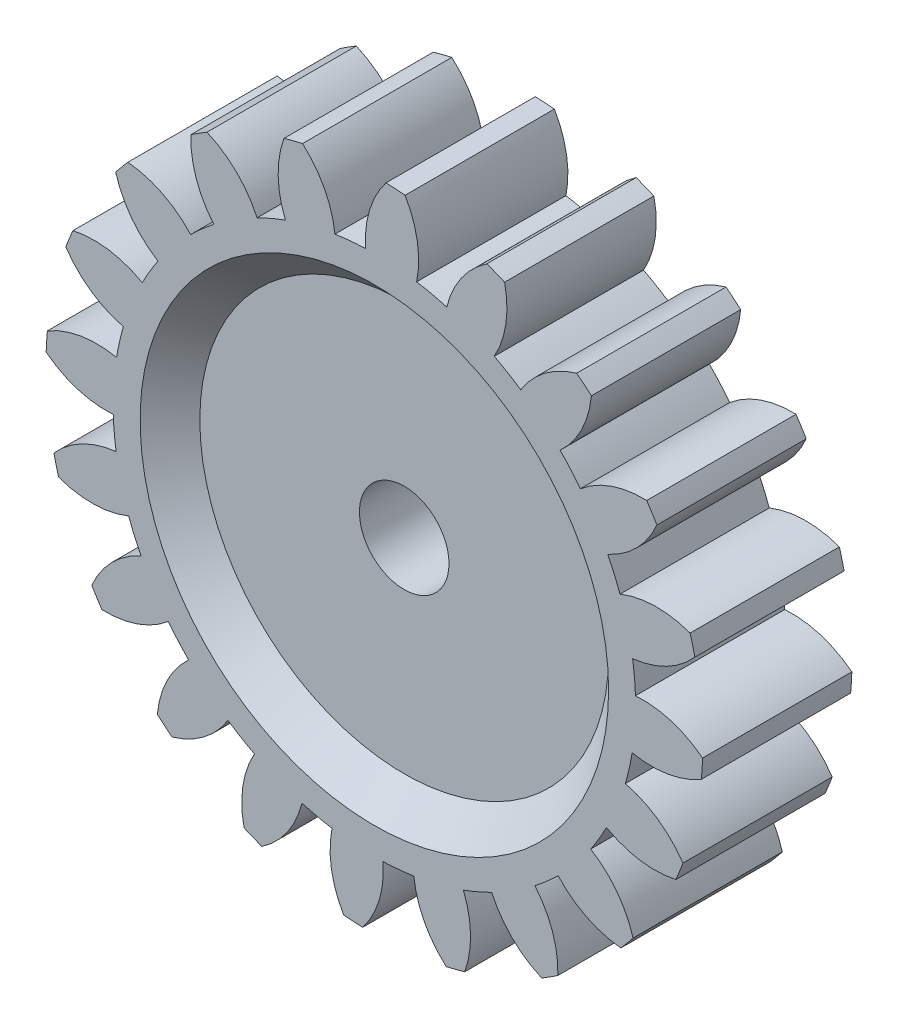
ISO-10303-21;
HEADER;
FILE_DESCRIPTION(('STEP AP214'),'2;1');
FILE_NAME('part.step','',(''),(''),'','','');
FILE_SCHEMA(('AUTOMOTIVE_DESIGN { 1 0 10303 214 1 1 1 1 }'));
ENDSEC;
DATA;
#1=APPLICATION_CONTEXT('core data for automotive mechanical design processes');
#2=APPLICATION_PROTOCOL_DEFINITION('international standard','automotive_design',2000,#1);
#3=PRODUCT_CONTEXT('',#1,'mechanical');
#4=PRODUCT('Part','Part','',(#3));
#5=PRODUCT_RELATED_PRODUCT_CATEGORY('part','',(#4));
#6=PRODUCT_DEFINITION_FORMATION('','',#4);
#7=PRODUCT_DEFINITION_CONTEXT('part definition',#1,'design');
#8=PRODUCT_DEFINITION('design','',#6,#7);
#9=PRODUCT_DEFINITION_SHAPE('','',#8);
#10=(LENGTH_UNIT() NAMED_UNIT(*) SI_UNIT(.MILLI.,.METRE.));
#11=(NAMED_UNIT(*) PLANE_ANGLE_UNIT() SI_UNIT($,.RADIAN.));
#12=(NAMED_UNIT(*) SI_UNIT($,.STERADIAN.) SOLID_ANGLE_UNIT());
#13=UNCERTAINTY_MEASURE_WITH_UNIT(LENGTH_MEASURE(1.E-05),#10,'distance_accuracy_value','');
#14=(GEOMETRIC_REPRESENTATION_CONTEXT(3) GLOBAL_UNCERTAINTY_ASSIGNED_CONTEXT((#13)) GLOBAL_UNIT_ASSIGNED_CONTEXT((#10,
#11,#12)) REPRESENTATION_CONTEXT('',''));
#15=CARTESIAN_POINT('',(0.,0.,0.));
#16=DIRECTION('',(0.,0.,1.));
#17=DIRECTION('',(1.,0.,0.));
#18=AXIS2_PLACEMENT_3D('',#15,#16,#17);
#19=CARTESIAN_POINT('',(0.,0.,0.));
#20=DIRECTION('',(0.,0.,1.));
#21=DIRECTION('',(1.,0.,0.));
#22=AXIS2_PLACEMENT_3D('',#19,#20,#21);
#23=CYLINDRICAL_SURFACE('',#22,1.5);
#24=CARTESIAN_POINT('',(0.,0.,4.));
#25=DIRECTION('',(0.,0.,1.));
#26=DIRECTION('',(1.,0.,0.));
#27=AXIS2_PLACEMENT_3D('',#24,#25,#26);
#28=CIRCLE('',#27,1.5);
#29=CARTESIAN_POINT('',(1.5,0.,4.));
#30=VERTEX_POINT('',#29);
#31=EDGE_CURVE('E568',#30,#30,#28,.F.);
#32=ORIENTED_EDGE('',*,*,#31,.F.);
#33=EDGE_LOOP('',(#32));
#34=FACE_BOUND('',#33,.T.);
#35=CARTESIAN_POINT('',(0.,0.,1.));
#36=DIRECTION('',(0.,0.,-1.));
#37=DIRECTION('',(-1.,0.,0.));
#38=AXIS2_PLACEMENT_3D('',#35,#36,#37);
#39=CIRCLE('',#38,1.5);
#40=CARTESIAN_POINT('',(-1.5,0.,1.));
#41=VERTEX_POINT('',#40);
#42=EDGE_CURVE('E1110',#41,#41,#39,.F.);
#43=ORIENTED_EDGE('',*,*,#42,.F.);
#44=EDGE_LOOP('',(#43));
#45=FACE_BOUND('',#44,.T.);
#46=ADVANCED_FACE('F33',(#34,#45),#23,.F.);
#47=CARTESIAN_POINT('',(0.,0.,5.));
#48=DIRECTION('',(0.,0.,-1.));
#49=DIRECTION('',(-1.,0.,0.));
#50=AXIS2_PLACEMENT_3D('',#47,#48,#49);
#51=CYLINDRICAL_SURFACE('',#50,8.75000000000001);
#52=CARTESIAN_POINT('',(0.,0.,5.));
#53=DIRECTION('',(0.,0.,1.));
#54=DIRECTION('',(1.,0.,0.));
#55=AXIS2_PLACEMENT_3D('',#52,#53,#54);
#56=CIRCLE('',#55,8.75000000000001);
#57=CARTESIAN_POINT('',(8.22658551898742,2.98090434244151,5.));
#58=VERTEX_POINT('',#57);
#59=CARTESIAN_POINT('',(7.81818839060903,3.9291767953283,5.));
#60=VERTEX_POINT('',#59);
#61=EDGE_CURVE('E48',#58,#60,#56,.T.);
#62=ORIENTED_EDGE('',*,*,#61,.F.);
#63=DIRECTION('',(0.,0.,1.));
#64=VECTOR('',#63,1.);
#65=CARTESIAN_POINT('',(8.22658551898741,2.9809043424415,0.));
#66=LINE('',#65,#64);
#67=CARTESIAN_POINT('',(8.22658551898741,2.9809043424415,0.));
#68=VERTEX_POINT('',#67);
#69=EDGE_CURVE('E544',#68,#58,#66,.T.);
#70=ORIENTED_EDGE('',*,*,#69,.F.);
#71=CARTESIAN_POINT('',(0.,0.,0.));
#72=DIRECTION('',(0.,0.,1.));
#73=DIRECTION('',(1.,0.,0.));
#74=AXIS2_PLACEMENT_3D('',#71,#72,#73);
#75=CIRCLE('',#74,8.75000000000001);
#76=CARTESIAN_POINT('',(7.81818839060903,3.9291767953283,0.));
#77=VERTEX_POINT('',#76);
#78=EDGE_CURVE('E531',#68,#77,#75,.T.);
#79=ORIENTED_EDGE('',*,*,#78,.T.);
#80=DIRECTION('',(0.,0.,1.));
#81=VECTOR('',#80,1.);
#82=CARTESIAN_POINT('',(7.81818839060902,3.9291767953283,0.));
#83=LINE('',#82,#81);
#84=EDGE_CURVE('E597',#77,#60,#83,.T.);
#85=ORIENTED_EDGE('',*,*,#84,.T.);
#86=EDGE_LOOP('',(#62,#70,#79,#85));
#87=FACE_BOUND('',#86,.T.);
#88=ADVANCED_FACE('F545',(#87),#51,.T.);
#89=CARTESIAN_POINT('',(6.90279766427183,5.37716323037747,5.));
#90=VERTEX_POINT('',#89);
#91=CARTESIAN_POINT('',(6.22135661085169,6.15282227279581,5.));
#92=VERTEX_POINT('',#91);
#93=EDGE_CURVE('E1488',#90,#92,#56,.T.);
#94=ORIENTED_EDGE('',*,*,#93,.F.);
#95=DIRECTION('',(0.,0.,1.));
#96=VECTOR('',#95,1.);
#97=CARTESIAN_POINT('',(6.90279766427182,5.37716323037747,0.));
#98=LINE('',#97,#96);
#99=CARTESIAN_POINT('',(6.90279766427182,5.37716323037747,0.));
#100=VERTEX_POINT('',#99);
#101=EDGE_CURVE('E584',#100,#90,#98,.T.);
#102=ORIENTED_EDGE('',*,*,#101,.F.);
#103=CARTESIAN_POINT('',(6.22135661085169,6.15282227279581,0.));
#104=VERTEX_POINT('',#103);
#105=EDGE_CURVE('E542',#100,#104,#75,.T.);
#106=ORIENTED_EDGE('',*,*,#105,.T.);
#107=DIRECTION('',(0.,0.,1.));
#108=VECTOR('',#107,1.);
#109=CARTESIAN_POINT('',(6.22135661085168,6.1528222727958,0.));
#110=LINE('',#109,#108);
#111=EDGE_CURVE('E624',#104,#92,#110,.T.);
#112=ORIENTED_EDGE('',*,*,#111,.T.);
#113=EDGE_LOOP('',(#94,#102,#106,#112));
#114=FACE_BOUND('',#113,.T.);
#115=ADVANCED_FACE('F1137',(#114),#51,.T.);
#116=CARTESIAN_POINT('',(4.90331587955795,7.24706791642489,5.));
#117=VERTEX_POINT('',#116);
#118=CARTESIAN_POINT('',(4.01553509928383,7.77418663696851,5.));
#119=VERTEX_POINT('',#118);
#120=EDGE_CURVE('E1490',#117,#119,#56,.T.);
#121=ORIENTED_EDGE('',*,*,#120,.F.);
#122=DIRECTION('',(0.,0.,1.));
#123=VECTOR('',#122,1.);
#124=CARTESIAN_POINT('',(4.90331587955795,7.24706791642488,0.));
#125=LINE('',#124,#123);
#126=CARTESIAN_POINT('',(4.90331587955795,7.24706791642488,0.));
#127=VERTEX_POINT('',#126);
#128=EDGE_CURVE('E611',#127,#117,#125,.T.);
#129=ORIENTED_EDGE('',*,*,#128,.F.);
#130=CARTESIAN_POINT('',(4.01553509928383,7.77418663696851,0.));
#131=VERTEX_POINT('',#130);
#132=EDGE_CURVE('E1471',#127,#131,#75,.T.);
#133=ORIENTED_EDGE('',*,*,#132,.T.);
#134=DIRECTION('',(0.,0.,1.));
#135=VECTOR('',#134,1.);
#136=CARTESIAN_POINT('',(4.01553509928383,7.7741866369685,0.));
#137=LINE('',#136,#135);
#138=EDGE_CURVE('E652',#131,#119,#137,.T.);
#139=ORIENTED_EDGE('',*,*,#138,.T.);
#140=EDGE_LOOP('',(#121,#129,#133,#139));
#141=FACE_BOUND('',#140,.T.);
#142=ADVANCED_FACE('F1608',(#141),#51,.T.);
#143=CARTESIAN_POINT('',(2.42386337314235,8.40757910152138,5.));
#144=VERTEX_POINT('',#143);
#145=CARTESIAN_POINT('',(1.4166450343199,8.6345594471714,5.));
#146=VERTEX_POINT('',#145);
#147=EDGE_CURVE('E1491',#144,#146,#56,.T.);
#148=ORIENTED_EDGE('',*,*,#147,.F.);
#149=DIRECTION('',(0.,0.,1.));
#150=VECTOR('',#149,1.);
#151=CARTESIAN_POINT('',(2.42386337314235,8.40757910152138,0.));
#152=LINE('',#151,#150);
#153=CARTESIAN_POINT('',(2.42386337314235,8.40757910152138,0.));
#154=VERTEX_POINT('',#153);
#155=EDGE_CURVE('E639',#154,#144,#152,.T.);
#156=ORIENTED_EDGE('',*,*,#155,.F.);
#157=CARTESIAN_POINT('',(1.4166450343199,8.6345594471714,0.));
#158=VERTEX_POINT('',#157);
#159=EDGE_CURVE('E1467',#154,#158,#75,.T.);
#160=ORIENTED_EDGE('',*,*,#159,.T.);
#161=DIRECTION('',(0.,0.,1.));
#162=VECTOR('',#161,1.);
#163=CARTESIAN_POINT('',(1.4166450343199,8.6345594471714,0.));
#164=LINE('',#163,#162);
#165=EDGE_CURVE('E680',#158,#146,#164,.T.);
#166=ORIENTED_EDGE('',*,*,#165,.T.);
#167=EDGE_LOOP('',(#148,#156,#160,#166));
#168=FACE_BOUND('',#167,.T.);
#169=ADVANCED_FACE('F1602',(#168),#51,.T.);
#170=CARTESIAN_POINT('',(-0.292853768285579,8.74509786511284,5.));
#171=VERTEX_POINT('',#170);
#172=CARTESIAN_POINT('',(-1.32091611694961,8.64972141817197,5.));
#173=VERTEX_POINT('',#172);
#174=EDGE_CURVE('E1492',#171,#173,#56,.T.);
#175=ORIENTED_EDGE('',*,*,#174,.F.);
#176=DIRECTION('',(0.,0.,1.));
#177=VECTOR('',#176,1.);
#178=CARTESIAN_POINT('',(-0.292853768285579,8.74509786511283,0.));
#179=LINE('',#178,#177);
#180=CARTESIAN_POINT('',(-0.292853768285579,8.74509786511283,0.));
#181=VERTEX_POINT('',#180);
#182=EDGE_CURVE('E667',#181,#171,#179,.T.);
#183=ORIENTED_EDGE('',*,*,#182,.F.);
#184=CARTESIAN_POINT('',(-1.32091611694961,8.64972141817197,0.));
#185=VERTEX_POINT('',#184);
#186=EDGE_CURVE('E1463',#181,#185,#75,.T.);
#187=ORIENTED_EDGE('',*,*,#186,.T.);
#188=DIRECTION('',(0.,0.,1.));
#189=VECTOR('',#188,1.);
#190=CARTESIAN_POINT('',(-1.32091611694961,8.64972141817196,0.));
#191=LINE('',#190,#189);
#192=EDGE_CURVE('E708',#185,#173,#191,.T.);
#193=ORIENTED_EDGE('',*,*,#192,.T.);
#194=EDGE_LOOP('',(#175,#183,#187,#193));
#195=FACE_BOUND('',#194,.T.);
#196=ADVANCED_FACE('F1595',(#195),#51,.T.);
#197=CARTESIAN_POINT('',(-2.98090434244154,8.22658551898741,5.));
#198=VERTEX_POINT('',#197);
#199=CARTESIAN_POINT('',(-3.92917679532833,7.81818839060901,5.));
#200=VERTEX_POINT('',#199);
#201=EDGE_CURVE('E1493',#198,#200,#56,.T.);
#202=ORIENTED_EDGE('',*,*,#201,.F.);
#203=DIRECTION('',(0.,0.,1.));
#204=VECTOR('',#203,1.);
#205=CARTESIAN_POINT('',(-2.98090434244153,8.2265855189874,0.));
#206=LINE('',#205,#204);
#207=CARTESIAN_POINT('',(-2.98090434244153,8.2265855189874,0.));
#208=VERTEX_POINT('',#207);
#209=EDGE_CURVE('E695',#208,#198,#206,.T.);
#210=ORIENTED_EDGE('',*,*,#209,.F.);
#211=CARTESIAN_POINT('',(-3.92917679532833,7.81818839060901,0.));
#212=VERTEX_POINT('',#211);
#213=EDGE_CURVE('E1459',#208,#212,#75,.T.);
#214=ORIENTED_EDGE('',*,*,#213,.T.);
#215=DIRECTION('',(0.,0.,1.));
#216=VECTOR('',#215,1.);
#217=CARTESIAN_POINT('',(-3.92917679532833,7.81818839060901,0.));
#218=LINE('',#217,#216);
#219=EDGE_CURVE('E736',#212,#200,#218,.T.);
#220=ORIENTED_EDGE('',*,*,#219,.T.);
#221=EDGE_LOOP('',(#202,#210,#214,#220));
#222=FACE_BOUND('',#221,.T.);
#223=ADVANCED_FACE('F1588',(#222),#51,.T.);
#224=CARTESIAN_POINT('',(-5.3771632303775,6.90279766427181,5.));
#225=VERTEX_POINT('',#224);
#226=CARTESIAN_POINT('',(-6.15282227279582,6.22135661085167,5.));
#227=VERTEX_POINT('',#226);
#228=EDGE_CURVE('E1494',#225,#227,#56,.T.);
#229=ORIENTED_EDGE('',*,*,#228,.F.);
#230=DIRECTION('',(0.,0.,1.));
#231=VECTOR('',#230,1.);
#232=CARTESIAN_POINT('',(-5.37716323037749,6.9027976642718,0.));
#233=LINE('',#232,#231);
#234=CARTESIAN_POINT('',(-5.37716323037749,6.9027976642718,0.));
#235=VERTEX_POINT('',#234);
#236=EDGE_CURVE('E723',#235,#225,#233,.T.);
#237=ORIENTED_EDGE('',*,*,#236,.F.);
#238=CARTESIAN_POINT('',(-6.15282227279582,6.22135661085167,0.));
#239=VERTEX_POINT('',#238);
#240=EDGE_CURVE('E1455',#235,#239,#75,.T.);
#241=ORIENTED_EDGE('',*,*,#240,.T.);
#242=DIRECTION('',(0.,0.,1.));
#243=VECTOR('',#242,1.);
#244=CARTESIAN_POINT('',(-6.15282227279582,6.22135661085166,0.));
#245=LINE('',#244,#243);
#246=EDGE_CURVE('E764',#239,#227,#245,.T.);
#247=ORIENTED_EDGE('',*,*,#246,.T.);
#248=EDGE_LOOP('',(#229,#237,#241,#247));
#249=FACE_BOUND('',#248,.T.);
#250=ADVANCED_FACE('F1581',(#249),#51,.T.);
#251=CARTESIAN_POINT('',(-7.2470679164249,4.90331587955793,5.));
#252=VERTEX_POINT('',#251);
#253=CARTESIAN_POINT('',(-7.77418663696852,4.0155350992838,5.));
#254=VERTEX_POINT('',#253);
#255=EDGE_CURVE('E1495',#252,#254,#56,.T.);
#256=ORIENTED_EDGE('',*,*,#255,.F.);
#257=DIRECTION('',(0.,0.,1.));
#258=VECTOR('',#257,1.);
#259=CARTESIAN_POINT('',(-7.2470679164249,4.90331587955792,0.));
#260=LINE('',#259,#258);
#261=CARTESIAN_POINT('',(-7.2470679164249,4.90331587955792,0.));
#262=VERTEX_POINT('',#261);
#263=EDGE_CURVE('E751',#262,#252,#260,.T.);
#264=ORIENTED_EDGE('',*,*,#263,.F.);
#265=CARTESIAN_POINT('',(-7.77418663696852,4.0155350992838,0.));
#266=VERTEX_POINT('',#265);
#267=EDGE_CURVE('E1451',#262,#266,#75,.T.);
#268=ORIENTED_EDGE('',*,*,#267,.T.);
#269=DIRECTION('',(0.,0.,1.));
#270=VECTOR('',#269,1.);
#271=CARTESIAN_POINT('',(-7.77418663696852,4.0155350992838,0.));
#272=LINE('',#271,#270);
#273=EDGE_CURVE('E792',#266,#254,#272,.T.);
#274=ORIENTED_EDGE('',*,*,#273,.T.);
#275=EDGE_LOOP('',(#256,#264,#268,#274));
#276=FACE_BOUND('',#275,.T.);
#277=ADVANCED_FACE('F1574',(#276),#51,.T.);
#278=CARTESIAN_POINT('',(-8.40757910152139,2.42386337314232,5.));
#279=VERTEX_POINT('',#278);
#280=CARTESIAN_POINT('',(-8.63455944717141,1.41664503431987,5.));
#281=VERTEX_POINT('',#280);
#282=EDGE_CURVE('E1496',#279,#281,#56,.T.);
#283=ORIENTED_EDGE('',*,*,#282,.F.);
#284=DIRECTION('',(0.,0.,1.));
#285=VECTOR('',#284,1.);
#286=CARTESIAN_POINT('',(-8.40757910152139,2.42386337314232,0.));
#287=LINE('',#286,#285);
#288=CARTESIAN_POINT('',(-8.40757910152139,2.42386337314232,0.));
#289=VERTEX_POINT('',#288);
#290=EDGE_CURVE('E779',#289,#279,#287,.T.);
#291=ORIENTED_EDGE('',*,*,#290,.F.);
#292=CARTESIAN_POINT('',(-8.63455944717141,1.41664503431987,0.));
#293=VERTEX_POINT('',#292);
#294=EDGE_CURVE('E1447',#289,#293,#75,.T.);
#295=ORIENTED_EDGE('',*,*,#294,.T.);
#296=DIRECTION('',(0.,0.,1.));
#297=VECTOR('',#296,1.);
#298=CARTESIAN_POINT('',(-8.6345594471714,1.41664503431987,0.));
#299=LINE('',#298,#297);
#300=EDGE_CURVE('E820',#293,#281,#299,.T.);
#301=ORIENTED_EDGE('',*,*,#300,.T.);
#302=EDGE_LOOP('',(#283,#291,#295,#301));
#303=FACE_BOUND('',#302,.T.);
#304=ADVANCED_FACE('F1567',(#303),#51,.T.);
#305=CARTESIAN_POINT('',(-8.74509786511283,-0.292853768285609,5.));
#306=VERTEX_POINT('',#305);
#307=CARTESIAN_POINT('',(-8.64972141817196,-1.32091611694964,5.));
#308=VERTEX_POINT('',#307);
#309=EDGE_CURVE('E1497',#306,#308,#56,.T.);
#310=ORIENTED_EDGE('',*,*,#309,.F.);
#311=DIRECTION('',(0.,0.,1.));
#312=VECTOR('',#311,1.);
#313=CARTESIAN_POINT('',(-8.74509786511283,-0.292853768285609,0.));
#314=LINE('',#313,#312);
#315=CARTESIAN_POINT('',(-8.74509786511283,-0.292853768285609,0.));
#316=VERTEX_POINT('',#315);
#317=EDGE_CURVE('E807',#316,#306,#314,.T.);
#318=ORIENTED_EDGE('',*,*,#317,.F.);
#319=CARTESIAN_POINT('',(-8.64972141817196,-1.32091611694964,0.));
#320=VERTEX_POINT('',#319);
#321=EDGE_CURVE('E1443',#316,#320,#75,.T.);
#322=ORIENTED_EDGE('',*,*,#321,.T.);
#323=DIRECTION('',(0.,0.,1.));
#324=VECTOR('',#323,1.);
#325=CARTESIAN_POINT('',(-8.64972141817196,-1.32091611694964,0.));
#326=LINE('',#325,#324);
#327=EDGE_CURVE('E848',#320,#308,#326,.T.);
#328=ORIENTED_EDGE('',*,*,#327,.T.);
#329=EDGE_LOOP('',(#310,#318,#322,#328));
#330=FACE_BOUND('',#329,.T.);
#331=ADVANCED_FACE('F1560',(#330),#51,.T.);
#332=CARTESIAN_POINT('',(-8.2265855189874,-2.98090434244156,5.));
#333=VERTEX_POINT('',#332);
#334=CARTESIAN_POINT('',(-7.818188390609,-3.92917679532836,5.));
#335=VERTEX_POINT('',#334);
#336=EDGE_CURVE('E1498',#333,#335,#56,.T.);
#337=ORIENTED_EDGE('',*,*,#336,.F.);
#338=DIRECTION('',(0.,0.,1.));
#339=VECTOR('',#338,1.);
#340=CARTESIAN_POINT('',(-8.2265855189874,-2.98090434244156,0.));
#341=LINE('',#340,#339);
#342=CARTESIAN_POINT('',(-8.2265855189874,-2.98090434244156,0.));
#343=VERTEX_POINT('',#342);
#344=EDGE_CURVE('E835',#343,#333,#341,.T.);
#345=ORIENTED_EDGE('',*,*,#344,.F.);
#346=CARTESIAN_POINT('',(-7.818188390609,-3.92917679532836,0.));
#347=VERTEX_POINT('',#346);
#348=EDGE_CURVE('E1439',#343,#347,#75,.T.);
#349=ORIENTED_EDGE('',*,*,#348,.T.);
#350=DIRECTION('',(0.,0.,1.));
#351=VECTOR('',#350,1.);
#352=CARTESIAN_POINT('',(-7.81818839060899,-3.92917679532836,0.));
#353=LINE('',#352,#351);
#354=EDGE_CURVE('E876',#347,#335,#353,.T.);
#355=ORIENTED_EDGE('',*,*,#354,.T.);
#356=EDGE_LOOP('',(#337,#345,#349,#355));
#357=FACE_BOUND('',#356,.T.);
#358=ADVANCED_FACE('F1553',(#357),#51,.T.);
#359=CARTESIAN_POINT('',(-6.90279766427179,-5.37716323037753,5.));
#360=VERTEX_POINT('',#359);
#361=CARTESIAN_POINT('',(-6.22135661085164,-6.15282227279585,5.));
#362=VERTEX_POINT('',#361);
#363=EDGE_CURVE('E1499',#360,#362,#56,.T.);
#364=ORIENTED_EDGE('',*,*,#363,.F.);
#365=DIRECTION('',(0.,0.,1.));
#366=VECTOR('',#365,1.);
#367=CARTESIAN_POINT('',(-6.90279766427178,-5.37716323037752,0.));
#368=LINE('',#367,#366);
#369=CARTESIAN_POINT('',(-6.90279766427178,-5.37716323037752,0.));
#370=VERTEX_POINT('',#369);
#371=EDGE_CURVE('E863',#370,#360,#368,.T.);
#372=ORIENTED_EDGE('',*,*,#371,.F.);
#373=CARTESIAN_POINT('',(-6.22135661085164,-6.15282227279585,0.));
#374=VERTEX_POINT('',#373);
#375=EDGE_CURVE('E1435',#370,#374,#75,.T.);
#376=ORIENTED_EDGE('',*,*,#375,.T.);
#377=DIRECTION('',(0.,0.,1.));
#378=VECTOR('',#377,1.);
#379=CARTESIAN_POINT('',(-6.22135661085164,-6.15282227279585,0.));
#380=LINE('',#379,#378);
#381=EDGE_CURVE('E904',#374,#362,#380,.T.);
#382=ORIENTED_EDGE('',*,*,#381,.T.);
#383=EDGE_LOOP('',(#364,#372,#376,#382));
#384=FACE_BOUND('',#383,.T.);
#385=ADVANCED_FACE('F1546',(#384),#51,.T.);
#386=CARTESIAN_POINT('',(-4.9033158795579,-7.24706791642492,5.));
#387=VERTEX_POINT('',#386);
#388=CARTESIAN_POINT('',(-4.01553509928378,-7.77418663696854,5.));
#389=VERTEX_POINT('',#388);
#390=EDGE_CURVE('E1500',#387,#389,#56,.T.);
#391=ORIENTED_EDGE('',*,*,#390,.F.);
#392=DIRECTION('',(0.,0.,1.));
#393=VECTOR('',#392,1.);
#394=CARTESIAN_POINT('',(-4.90331587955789,-7.24706791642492,0.));
#395=LINE('',#394,#393);
#396=CARTESIAN_POINT('',(-4.90331587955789,-7.24706791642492,0.));
#397=VERTEX_POINT('',#396);
#398=EDGE_CURVE('E891',#397,#387,#395,.T.);
#399=ORIENTED_EDGE('',*,*,#398,.F.);
#400=CARTESIAN_POINT('',(-4.01553509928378,-7.77418663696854,0.));
#401=VERTEX_POINT('',#400);
#402=EDGE_CURVE('E1431',#397,#401,#75,.T.);
#403=ORIENTED_EDGE('',*,*,#402,.T.);
#404=DIRECTION('',(0.,0.,1.));
#405=VECTOR('',#404,1.);
#406=CARTESIAN_POINT('',(-4.01553509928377,-7.77418663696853,0.));
#407=LINE('',#406,#405);
#408=EDGE_CURVE('E932',#401,#389,#407,.T.);
#409=ORIENTED_EDGE('',*,*,#408,.T.);
#410=EDGE_LOOP('',(#391,#399,#403,#409));
#411=FACE_BOUND('',#410,.T.);
#412=ADVANCED_FACE('F1539',(#411),#51,.T.);
#413=CARTESIAN_POINT('',(-2.4238633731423,-8.4075791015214,5.));
#414=VERTEX_POINT('',#413);
#415=CARTESIAN_POINT('',(-1.41664503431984,-8.63455944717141,5.));
#416=VERTEX_POINT('',#415);
#417=EDGE_CURVE('E1501',#414,#416,#56,.T.);
#418=ORIENTED_EDGE('',*,*,#417,.F.);
#419=DIRECTION('',(0.,0.,1.));
#420=VECTOR('',#419,1.);
#421=CARTESIAN_POINT('',(-2.42386337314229,-8.40757910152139,0.));
#422=LINE('',#421,#420);
#423=CARTESIAN_POINT('',(-2.42386337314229,-8.40757910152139,0.));
#424=VERTEX_POINT('',#423);
#425=EDGE_CURVE('E919',#424,#414,#422,.T.);
#426=ORIENTED_EDGE('',*,*,#425,.F.);
#427=CARTESIAN_POINT('',(-1.41664503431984,-8.63455944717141,0.));
#428=VERTEX_POINT('',#427);
#429=EDGE_CURVE('E1427',#424,#428,#75,.T.);
#430=ORIENTED_EDGE('',*,*,#429,.T.);
#431=DIRECTION('',(0.,0.,1.));
#432=VECTOR('',#431,1.);
#433=CARTESIAN_POINT('',(-1.41664503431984,-8.63455944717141,0.));
#434=LINE('',#433,#432);
#435=EDGE_CURVE('E960',#428,#416,#434,.T.);
#436=ORIENTED_EDGE('',*,*,#435,.T.);
#437=EDGE_LOOP('',(#418,#426,#430,#436));
#438=FACE_BOUND('',#437,.T.);
#439=ADVANCED_FACE('F1532',(#438),#51,.T.);
#440=CARTESIAN_POINT('',(0.29285376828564,-8.74509786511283,5.));
#441=VERTEX_POINT('',#440);
#442=CARTESIAN_POINT('',(1.32091611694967,-8.64972141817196,5.));
#443=VERTEX_POINT('',#442);
#444=EDGE_CURVE('E1502',#441,#443,#56,.T.);
#445=ORIENTED_EDGE('',*,*,#444,.F.);
#446=DIRECTION('',(0.,0.,1.));
#447=VECTOR('',#446,1.);
#448=CARTESIAN_POINT('',(0.29285376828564,-8.74509786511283,0.));
#449=LINE('',#448,#447);
#450=CARTESIAN_POINT('',(0.29285376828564,-8.74509786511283,0.));
#451=VERTEX_POINT('',#450);
#452=EDGE_CURVE('E947',#451,#441,#449,.T.);
#453=ORIENTED_EDGE('',*,*,#452,.F.);
#454=CARTESIAN_POINT('',(1.32091611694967,-8.64972141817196,0.));
#455=VERTEX_POINT('',#454);
#456=EDGE_CURVE('E1423',#451,#455,#75,.T.);
#457=ORIENTED_EDGE('',*,*,#456,.T.);
#458=DIRECTION('',(0.,0.,1.));
#459=VECTOR('',#458,1.);
#460=CARTESIAN_POINT('',(1.32091611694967,-8.64972141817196,0.));
#461=LINE('',#460,#459);
#462=EDGE_CURVE('E988',#455,#443,#461,.T.);
#463=ORIENTED_EDGE('',*,*,#462,.T.);
#464=EDGE_LOOP('',(#445,#453,#457,#463));
#465=FACE_BOUND('',#464,.T.);
#466=ADVANCED_FACE('F1525',(#465),#51,.T.);
#467=CARTESIAN_POINT('',(2.98090434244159,-8.22658551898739,5.));
#468=VERTEX_POINT('',#467);
#469=CARTESIAN_POINT('',(3.92917679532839,-7.81818839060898,5.));
#470=VERTEX_POINT('',#469);
#471=EDGE_CURVE('E1503',#468,#470,#56,.T.);
#472=ORIENTED_EDGE('',*,*,#471,.F.);
#473=DIRECTION('',(0.,0.,1.));
#474=VECTOR('',#473,1.);
#475=CARTESIAN_POINT('',(2.98090434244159,-8.22658551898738,0.));
#476=LINE('',#475,#474);
#477=CARTESIAN_POINT('',(2.98090434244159,-8.22658551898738,0.));
#478=VERTEX_POINT('',#477);
#479=EDGE_CURVE('E975',#478,#468,#476,.T.);
#480=ORIENTED_EDGE('',*,*,#479,.F.);
#481=CARTESIAN_POINT('',(3.92917679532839,-7.81818839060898,0.));
#482=VERTEX_POINT('',#481);
#483=EDGE_CURVE('E1419',#478,#482,#75,.T.);
#484=ORIENTED_EDGE('',*,*,#483,.T.);
#485=DIRECTION('',(0.,0.,1.));
#486=VECTOR('',#485,1.);
#487=CARTESIAN_POINT('',(3.92917679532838,-7.81818839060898,0.));
#488=LINE('',#487,#486);
#489=EDGE_CURVE('E1016',#482,#470,#488,.T.);
#490=ORIENTED_EDGE('',*,*,#489,.T.);
#491=EDGE_LOOP('',(#472,#480,#484,#490));
#492=FACE_BOUND('',#491,.T.);
#493=ADVANCED_FACE('F1518',(#492),#51,.T.);
#494=CARTESIAN_POINT('',(5.37716323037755,-6.90279766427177,5.));
#495=VERTEX_POINT('',#494);
#496=CARTESIAN_POINT('',(6.15282227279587,-6.22135661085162,5.));
#497=VERTEX_POINT('',#496);
#498=EDGE_CURVE('E1504',#495,#497,#56,.T.);
#499=ORIENTED_EDGE('',*,*,#498,.F.);
#500=DIRECTION('',(0.,0.,1.));
#501=VECTOR('',#500,1.);
#502=CARTESIAN_POINT('',(5.37716323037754,-6.90279766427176,0.));
#503=LINE('',#502,#501);
#504=CARTESIAN_POINT('',(5.37716323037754,-6.90279766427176,0.));
#505=VERTEX_POINT('',#504);
#506=EDGE_CURVE('E1003',#505,#495,#503,.T.);
#507=ORIENTED_EDGE('',*,*,#506,.F.);
#508=CARTESIAN_POINT('',(6.15282227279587,-6.22135661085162,0.));
#509=VERTEX_POINT('',#508);
#510=EDGE_CURVE('E1418',#505,#509,#75,.T.);
#511=ORIENTED_EDGE('',*,*,#510,.T.);
#512=DIRECTION('',(0.,0.,1.));
#513=VECTOR('',#512,1.);
#514=CARTESIAN_POINT('',(6.15282227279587,-6.22135661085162,0.));
#515=LINE('',#514,#513);
#516=EDGE_CURVE('E1044',#509,#497,#515,.T.);
#517=ORIENTED_EDGE('',*,*,#516,.T.);
#518=EDGE_LOOP('',(#499,#507,#511,#517));
#519=FACE_BOUND('',#518,.T.);
#520=ADVANCED_FACE('F1512',(#519),#51,.T.);
#521=CARTESIAN_POINT('',(7.24706791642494,-4.90331587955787,5.));
#522=VERTEX_POINT('',#521);
#523=CARTESIAN_POINT('',(7.77418663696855,-4.01553509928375,5.));
#524=VERTEX_POINT('',#523);
#525=EDGE_CURVE('E1417',#522,#524,#56,.T.);
#526=ORIENTED_EDGE('',*,*,#525,.F.);
#527=DIRECTION('',(0.,0.,1.));
#528=VECTOR('',#527,1.);
#529=CARTESIAN_POINT('',(7.24706791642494,-4.90331587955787,0.));
#530=LINE('',#529,#528);
#531=CARTESIAN_POINT('',(7.24706791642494,-4.90331587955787,0.));
#532=VERTEX_POINT('',#531);
#533=EDGE_CURVE('E1031',#532,#522,#530,.T.);
#534=ORIENTED_EDGE('',*,*,#533,.F.);
#535=CARTESIAN_POINT('',(7.77418663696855,-4.01553509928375,0.));
#536=VERTEX_POINT('',#535);
#537=EDGE_CURVE('E1408',#532,#536,#75,.T.);
#538=ORIENTED_EDGE('',*,*,#537,.T.);
#539=DIRECTION('',(0.,0.,1.));
#540=VECTOR('',#539,1.);
#541=CARTESIAN_POINT('',(7.77418663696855,-4.01553509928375,0.));
#542=LINE('',#541,#540);
#543=EDGE_CURVE('E1072',#536,#524,#542,.T.);
#544=ORIENTED_EDGE('',*,*,#543,.T.);
#545=EDGE_LOOP('',(#526,#534,#538,#544));
#546=FACE_BOUND('',#545,.T.);
#547=ADVANCED_FACE('F1391',(#546),#51,.T.);
#548=CARTESIAN_POINT('',(8.40757910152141,-2.42386337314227,5.));
#549=VERTEX_POINT('',#548);
#550=CARTESIAN_POINT('',(8.63455944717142,-1.41664503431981,5.));
#551=VERTEX_POINT('',#550);
#552=EDGE_CURVE('E1106',#549,#551,#56,.T.);
#553=ORIENTED_EDGE('',*,*,#552,.F.);
#554=DIRECTION('',(0.,0.,1.));
#555=VECTOR('',#554,1.);
#556=CARTESIAN_POINT('',(8.4075791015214,-2.42386337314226,0.));
#557=LINE('',#556,#555);
#558=CARTESIAN_POINT('',(8.4075791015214,-2.42386337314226,0.));
#559=VERTEX_POINT('',#558);
#560=EDGE_CURVE('E1059',#559,#549,#557,.T.);
#561=ORIENTED_EDGE('',*,*,#560,.F.);
#562=CARTESIAN_POINT('',(8.63455944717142,-1.41664503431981,0.));
#563=VERTEX_POINT('',#562);
#564=EDGE_CURVE('E1097',#559,#563,#75,.T.);
#565=ORIENTED_EDGE('',*,*,#564,.T.);
#566=DIRECTION('',(0.,0.,1.));
#567=VECTOR('',#566,1.);
#568=CARTESIAN_POINT('',(8.63455944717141,-1.41664503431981,0.));
#569=LINE('',#568,#567);
#570=EDGE_CURVE('E1100',#563,#551,#569,.T.);
#571=ORIENTED_EDGE('',*,*,#570,.T.);
#572=EDGE_LOOP('',(#553,#561,#565,#571));
#573=FACE_BOUND('',#572,.T.);
#574=ADVANCED_FACE('F1387',(#573),#51,.T.);
#575=CARTESIAN_POINT('',(8.74509786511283,0.29285376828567,0.));
#576=VERTEX_POINT('',#575);
#577=CARTESIAN_POINT('',(8.64972141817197,1.32091611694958,0.));
#578=VERTEX_POINT('',#577);
#579=EDGE_CURVE('E541',#576,#578,#75,.T.);
#580=ORIENTED_EDGE('',*,*,#579,.T.);
#581=DIRECTION('',(0.,0.,1.));
#582=VECTOR('',#581,1.);
#583=CARTESIAN_POINT('',(8.64972141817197,1.32091611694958,0.));
#584=LINE('',#583,#582);
#585=CARTESIAN_POINT('',(8.64972141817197,1.32091611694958,5.));
#586=VERTEX_POINT('',#585);
#587=EDGE_CURVE('E56',#578,#586,#584,.T.);
#588=ORIENTED_EDGE('',*,*,#587,.T.);
#589=CARTESIAN_POINT('',(8.74509786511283,0.29285376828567,5.));
#590=VERTEX_POINT('',#589);
#591=EDGE_CURVE('E1105',#590,#586,#56,.T.);
#592=ORIENTED_EDGE('',*,*,#591,.F.);
#593=DIRECTION('',(0.,0.,1.));
#594=VECTOR('',#593,1.);
#595=CARTESIAN_POINT('',(8.74509786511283,0.29285376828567,0.));
#596=LINE('',#595,#594);
#597=EDGE_CURVE('E1087',#576,#590,#596,.T.);
#598=ORIENTED_EDGE('',*,*,#597,.F.);
#599=EDGE_LOOP('',(#580,#588,#592,#598));
#600=FACE_BOUND('',#599,.T.);
#601=ADVANCED_FACE('F1138',(#600),#51,.T.);
#602=CARTESIAN_POINT('',(0.,0.,5.));
#603=DIRECTION('',(0.,0.,1.));
#604=DIRECTION('',(1.,0.,0.));
#605=AXIS2_PLACEMENT_3D('',#602,#603,#604);
#606=PLANE('',#605);
#607=CARTESIAN_POINT('',(0.,0.,5.));
#608=DIRECTION('',(0.,0.,1.));
#609=DIRECTION('',(1.,0.,0.));
#610=AXIS2_PLACEMENT_3D('',#607,#608,#609);
#611=CIRCLE('',#610,7.84618754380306);
#612=CARTESIAN_POINT('',(7.84618754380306,0.,5.));
#613=VERTEX_POINT('',#612);
#614=EDGE_CURVE('E11',#613,#613,#611,.F.);
#615=ORIENTED_EDGE('',*,*,#614,.T.);
#616=EDGE_LOOP('',(#615));
#617=FACE_BOUND('',#616,.T.);
#618=ORIENTED_EDGE('',*,*,#591,.T.);
#619=CARTESIAN_POINT('',(8.28665560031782,4.56242169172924,5.));
#620=DIRECTION('',(0.,0.,1.));
#621=DIRECTION('',(-0.951056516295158,-0.309016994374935,0.));
#622=AXIS2_PLACEMENT_3D('',#619,#620,#621);
#623=CIRCLE('',#622,3.2617748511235);
#624=CARTESIAN_POINT('',(10.733698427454,2.4057676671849,5.));
#625=VERTEX_POINT('',#624);
#626=EDGE_CURVE('E559',#586,#625,#623,.T.);
#627=ORIENTED_EDGE('',*,*,#626,.T.);
#628=CARTESIAN_POINT('',(0.,0.,5.));
#629=DIRECTION('',(0.,0.,1.));
#630=DIRECTION('',(0.951056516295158,0.309016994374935,0.));
#631=AXIS2_PLACEMENT_3D('',#628,#629,#630);
#632=CIRCLE('',#631,11.);
#633=CARTESIAN_POINT('',(10.575590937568,3.02603309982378,5.));
#634=VERTEX_POINT('',#633);
#635=EDGE_CURVE('E554',#625,#634,#632,.T.);
#636=ORIENTED_EDGE('',*,*,#635,.T.);
#637=CARTESIAN_POINT('',(9.45953710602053,-0.0388647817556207,5.));
#638=DIRECTION('',(0.,0.,1.));
#639=DIRECTION('',(0.951056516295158,0.309016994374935,0.));
#640=AXIS2_PLACEMENT_3D('',#637,#638,#639);
#641=CIRCLE('',#640,3.2617748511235);
#642=EDGE_CURVE('E566',#634,#58,#641,.T.);
#643=ORIENTED_EDGE('',*,*,#642,.T.);
#644=ORIENTED_EDGE('',*,*,#61,.T.);
#645=CARTESIAN_POINT('',(6.47121196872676,6.89983828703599,5.));
#646=DIRECTION('',(0.,0.,1.));
#647=DIRECTION('',(-0.809016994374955,-0.587785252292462,0.));
#648=AXIS2_PLACEMENT_3D('',#645,#646,#647);
#649=CIRCLE('',#648,3.2617748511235);
#650=CARTESIAN_POINT('',(9.46493073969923,5.60491624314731,5.));
#651=VERTEX_POINT('',#650);
#652=EDGE_CURVE('E587',#60,#651,#649,.T.);
#653=ORIENTED_EDGE('',*,*,#652,.T.);
#654=CARTESIAN_POINT('',(0.,0.,5.));
#655=DIRECTION('',(0.,0.,1.));
#656=DIRECTION('',(0.809016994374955,0.587785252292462,0.));
#657=AXIS2_PLACEMENT_3D('',#654,#655,#656);
#658=CIRCLE('',#657,11.);
#659=CARTESIAN_POINT('',(9.12288902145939,6.14596582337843,5.));
#660=VERTEX_POINT('',#659);
#661=EDGE_CURVE('E579',#651,#660,#658,.T.);
#662=ORIENTED_EDGE('',*,*,#661,.T.);
#663=CARTESIAN_POINT('',(9.00856428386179,2.88619512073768,5.));
#664=DIRECTION('',(0.,0.,1.));
#665=DIRECTION('',(0.809016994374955,0.587785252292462,0.));
#666=AXIS2_PLACEMENT_3D('',#663,#664,#665);
#667=CIRCLE('',#666,3.2617748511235);
#668=EDGE_CURVE('E572',#660,#90,#667,.T.);
#669=ORIENTED_EDGE('',*,*,#668,.T.);
#670=ORIENTED_EDGE('',*,*,#93,.T.);
#671=CARTESIAN_POINT('',(4.02232102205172,8.56185063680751,5.));
#672=DIRECTION('',(0.,0.,1.));
#673=DIRECTION('',(-0.587785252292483,-0.80901699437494,0.));
#674=AXIS2_PLACEMENT_3D('',#671,#672,#673);
#675=CIRCLE('',#674,3.2617748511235);
#676=CARTESIAN_POINT('',(7.26966968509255,8.25541656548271,5.));
#677=VERTEX_POINT('',#676);
#678=EDGE_CURVE('E614',#92,#677,#675,.T.);
#679=ORIENTED_EDGE('',*,*,#678,.T.);
#680=CARTESIAN_POINT('',(0.,0.,5.));
#681=DIRECTION('',(0.,0.,1.));
#682=DIRECTION('',(0.587785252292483,0.80901699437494,0.));
#683=AXIS2_PLACEMENT_3D('',#680,#681,#682);
#684=CIRCLE('',#683,11.);
#685=CARTESIAN_POINT('',(6.77717516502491,8.66428859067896,5.));
#686=VERTEX_POINT('',#685);
#687=EDGE_CURVE('E605',#677,#686,#684,.T.);
#688=ORIENTED_EDGE('',*,*,#687,.T.);
#689=CARTESIAN_POINT('',(7.67577042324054,5.52873413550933,5.));
#690=DIRECTION('',(0.,0.,1.));
#691=DIRECTION('',(0.587785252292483,0.80901699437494,0.));
#692=AXIS2_PLACEMENT_3D('',#689,#690,#691);
#693=CIRCLE('',#692,3.2617748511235);
#694=EDGE_CURVE('E594',#686,#117,#693,.T.);
#695=ORIENTED_EDGE('',*,*,#694,.T.);
#696=ORIENTED_EDGE('',*,*,#120,.T.);
#697=CARTESIAN_POINT('',(1.17969726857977,9.38576939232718,5.));
#698=DIRECTION('',(0.,0.,1.));
#699=DIRECTION('',(-0.309016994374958,-0.95105651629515,0.));
#700=AXIS2_PLACEMENT_3D('',#697,#698,#699);
#701=CIRCLE('',#700,3.2617748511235);
#702=CARTESIAN_POINT('',(4.36280271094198,10.0978191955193,5.));
#703=VERTEX_POINT('',#702);
#704=EDGE_CURVE('E642',#119,#703,#701,.T.);
#705=ORIENTED_EDGE('',*,*,#704,.T.);
#706=CARTESIAN_POINT('',(0.,0.,5.));
#707=DIRECTION('',(0.,0.,1.));
#708=DIRECTION('',(0.309016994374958,0.95105651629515,0.));
#709=AXIS2_PLACEMENT_3D('',#706,#707,#708);
#710=CIRCLE('',#709,11.);
#711=CARTESIAN_POINT('',(3.76806418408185,10.3344904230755,5.));
#712=VERTEX_POINT('',#711);
#713=EDGE_CURVE('E633',#703,#712,#710,.T.);
#714=ORIENTED_EDGE('',*,*,#713,.T.);
#715=CARTESIAN_POINT('',(5.59161867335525,7.63008213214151,5.));
#716=DIRECTION('',(0.,0.,1.));
#717=DIRECTION('',(0.309016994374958,0.95105651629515,0.));
#718=AXIS2_PLACEMENT_3D('',#715,#716,#717);
#719=CIRCLE('',#718,3.2617748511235);
#720=EDGE_CURVE('E621',#712,#144,#719,.T.);
#721=ORIENTED_EDGE('',*,*,#720,.T.);
#722=ORIENTED_EDGE('',*,*,#147,.T.);
#723=CARTESIAN_POINT('',(-1.77840347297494,9.29094364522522,5.));
#724=DIRECTION('',(0.,0.,1.));
#725=DIRECTION('',(0.,-1.,0.));
#726=AXIS2_PLACEMENT_3D('',#723,#724,#725);
#727=CIRCLE('',#726,3.2617748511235);
#728=CARTESIAN_POINT('',(1.02887421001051,10.951776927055,5.));
#729=VERTEX_POINT('',#728);
#730=EDGE_CURVE('E670',#146,#729,#727,.T.);
#731=ORIENTED_EDGE('',*,*,#730,.T.);
#732=CARTESIAN_POINT('',(0.,0.,5.));
#733=DIRECTION('',(0.,0.,1.));
#734=DIRECTION('',(0.,1.,0.));
#735=AXIS2_PLACEMENT_3D('',#732,#733,#734);
#736=CIRCLE('',#735,11.);
#737=CARTESIAN_POINT('',(0.390108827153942,10.9930803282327,5.));
#738=VERTEX_POINT('',#737);
#739=EDGE_CURVE('E661',#729,#738,#736,.T.);
#740=ORIENTED_EDGE('',*,*,#739,.T.);
#741=CARTESIAN_POINT('',(2.9601203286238,8.98454452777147,5.));
#742=DIRECTION('',(0.,0.,1.));
#743=DIRECTION('',(0.,1.,0.));
#744=AXIS2_PLACEMENT_3D('',#741,#742,#743);
#745=CIRCLE('',#744,3.2617748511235);
#746=EDGE_CURVE('E649',#738,#171,#745,.T.);
#747=ORIENTED_EDGE('',*,*,#746,.T.);
#748=ORIENTED_EDGE('',*,*,#174,.T.);
#749=CARTESIAN_POINT('',(-4.56242169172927,8.2866556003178,5.));
#750=DIRECTION('',(0.,0.,1.));
#751=DIRECTION('',(0.309016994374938,-0.951056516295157,0.));
#752=AXIS2_PLACEMENT_3D('',#749,#750,#751);
#753=CIRCLE('',#752,3.2617748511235);
#754=CARTESIAN_POINT('',(-2.40576766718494,10.733698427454,5.));
#755=VERTEX_POINT('',#754);
#756=EDGE_CURVE('E698',#173,#755,#753,.T.);
#757=ORIENTED_EDGE('',*,*,#756,.T.);
#758=CARTESIAN_POINT('',(0.,0.,5.));
#759=DIRECTION('',(0.,0.,1.));
#760=DIRECTION('',(-0.309016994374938,0.951056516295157,0.));
#761=AXIS2_PLACEMENT_3D('',#758,#759,#760);
#762=CIRCLE('',#761,11.);
#763=CARTESIAN_POINT('',(-3.02603309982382,10.575590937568,5.));
#764=VERTEX_POINT('',#763);
#765=EDGE_CURVE('E689',#755,#764,#762,.T.);
#766=ORIENTED_EDGE('',*,*,#765,.T.);
#767=CARTESIAN_POINT('',(0.0388647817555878,9.45953710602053,5.));
#768=DIRECTION('',(0.,0.,1.));
#769=DIRECTION('',(-0.309016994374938,0.951056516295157,0.));
#770=AXIS2_PLACEMENT_3D('',#767,#768,#769);
#771=CIRCLE('',#770,3.2617748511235);
#772=EDGE_CURVE('E677',#764,#198,#771,.T.);
#773=ORIENTED_EDGE('',*,*,#772,.T.);
#774=ORIENTED_EDGE('',*,*,#201,.T.);
#775=CARTESIAN_POINT('',(-6.89983828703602,6.47121196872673,5.));
#776=DIRECTION('',(0.,0.,1.));
#777=DIRECTION('',(0.587785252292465,-0.809016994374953,0.));
#778=AXIS2_PLACEMENT_3D('',#775,#776,#777);
#779=CIRCLE('',#778,3.2617748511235);
#780=CARTESIAN_POINT('',(-5.60491624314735,9.46493073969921,5.));
#781=VERTEX_POINT('',#780);
#782=EDGE_CURVE('E726',#200,#781,#779,.T.);
#783=ORIENTED_EDGE('',*,*,#782,.T.);
#784=CARTESIAN_POINT('',(0.,0.,5.));
#785=DIRECTION('',(0.,0.,1.));
#786=DIRECTION('',(-0.587785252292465,0.809016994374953,0.));
#787=AXIS2_PLACEMENT_3D('',#784,#785,#786);
#788=CIRCLE('',#787,11.);
#789=CARTESIAN_POINT('',(-6.14596582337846,9.12288902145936,5.));
#790=VERTEX_POINT('',#789);
#791=EDGE_CURVE('E717',#781,#790,#788,.T.);
#792=ORIENTED_EDGE('',*,*,#791,.T.);
#793=CARTESIAN_POINT('',(-2.88619512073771,9.00856428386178,5.));
#794=DIRECTION('',(0.,0.,1.));
#795=DIRECTION('',(-0.587785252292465,0.809016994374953,0.));
#796=AXIS2_PLACEMENT_3D('',#793,#794,#795);
#797=CIRCLE('',#796,3.2617748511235);
#798=EDGE_CURVE('E705',#790,#225,#797,.T.);
#799=ORIENTED_EDGE('',*,*,#798,.T.);
#800=ORIENTED_EDGE('',*,*,#228,.T.);
#801=CARTESIAN_POINT('',(-8.56185063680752,4.02232102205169,5.));
#802=DIRECTION('',(0.,0.,1.));
#803=DIRECTION('',(0.809016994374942,-0.58778525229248,0.));
#804=AXIS2_PLACEMENT_3D('',#801,#802,#803);
#805=CIRCLE('',#804,3.2617748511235);
#806=CARTESIAN_POINT('',(-8.25541656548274,7.26966968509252,5.));
#807=VERTEX_POINT('',#806);
#808=EDGE_CURVE('E754',#227,#807,#805,.T.);
#809=ORIENTED_EDGE('',*,*,#808,.T.);
#810=CARTESIAN_POINT('',(0.,0.,5.));
#811=DIRECTION('',(0.,0.,1.));
#812=DIRECTION('',(-0.809016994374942,0.58778525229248,0.));
#813=AXIS2_PLACEMENT_3D('',#810,#811,#812);
#814=CIRCLE('',#813,11.);
#815=CARTESIAN_POINT('',(-8.66428859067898,6.77717516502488,5.));
#816=VERTEX_POINT('',#815);
#817=EDGE_CURVE('E745',#807,#816,#814,.T.);
#818=ORIENTED_EDGE('',*,*,#817,.T.);
#819=CARTESIAN_POINT('',(-5.52873413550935,7.67577042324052,5.));
#820=DIRECTION('',(0.,0.,1.));
#821=DIRECTION('',(-0.809016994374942,0.58778525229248,0.));
#822=AXIS2_PLACEMENT_3D('',#819,#820,#821);
#823=CIRCLE('',#822,3.2617748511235);
#824=EDGE_CURVE('E733',#816,#252,#823,.T.);
#825=ORIENTED_EDGE('',*,*,#824,.T.);
#826=ORIENTED_EDGE('',*,*,#255,.T.);
#827=CARTESIAN_POINT('',(-9.38576939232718,1.17969726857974,5.));
#828=DIRECTION('',(0.,0.,1.));
#829=DIRECTION('',(0.951056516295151,-0.309016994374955,0.));
#830=AXIS2_PLACEMENT_3D('',#827,#828,#829);
#831=CIRCLE('',#830,3.2617748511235);
#832=CARTESIAN_POINT('',(-10.0978191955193,4.36280271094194,5.));
#833=VERTEX_POINT('',#832);
#834=EDGE_CURVE('E782',#254,#833,#831,.T.);
#835=ORIENTED_EDGE('',*,*,#834,.T.);
#836=CARTESIAN_POINT('',(0.,0.,5.));
#837=DIRECTION('',(0.,0.,1.));
#838=DIRECTION('',(-0.951056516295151,0.309016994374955,0.));
#839=AXIS2_PLACEMENT_3D('',#836,#837,#838);
#840=CIRCLE('',#839,11.);
#841=CARTESIAN_POINT('',(-10.3344904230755,3.76806418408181,5.));
#842=VERTEX_POINT('',#841);
#843=EDGE_CURVE('E773',#833,#842,#840,.T.);
#844=ORIENTED_EDGE('',*,*,#843,.T.);
#845=CARTESIAN_POINT('',(-7.63008213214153,5.59161867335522,5.));
#846=DIRECTION('',(0.,0.,1.));
#847=DIRECTION('',(-0.951056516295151,0.309016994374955,0.));
#848=AXIS2_PLACEMENT_3D('',#845,#846,#847);
#849=CIRCLE('',#848,3.2617748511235);
#850=EDGE_CURVE('E761',#842,#279,#849,.T.);
#851=ORIENTED_EDGE('',*,*,#850,.T.);
#852=ORIENTED_EDGE('',*,*,#282,.T.);
#853=CARTESIAN_POINT('',(-9.29094364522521,-1.77840347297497,5.));
#854=DIRECTION('',(0.,0.,1.));
#855=DIRECTION('',(1.,0.,0.));
#856=AXIS2_PLACEMENT_3D('',#853,#854,#855);
#857=CIRCLE('',#856,3.2617748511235);
#858=CARTESIAN_POINT('',(-10.951776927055,1.02887421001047,5.));
#859=VERTEX_POINT('',#858);
#860=EDGE_CURVE('E810',#281,#859,#857,.T.);
#861=ORIENTED_EDGE('',*,*,#860,.T.);
#862=CARTESIAN_POINT('',(0.,0.,5.));
#863=DIRECTION('',(0.,0.,1.));
#864=DIRECTION('',(-1.,0.,0.));
#865=AXIS2_PLACEMENT_3D('',#862,#863,#864);
#866=CIRCLE('',#865,11.);
#867=CARTESIAN_POINT('',(-10.9930803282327,0.390108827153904,5.));
#868=VERTEX_POINT('',#867);
#869=EDGE_CURVE('E801',#859,#868,#866,.T.);
#870=ORIENTED_EDGE('',*,*,#869,.T.);
#871=CARTESIAN_POINT('',(-8.98454452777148,2.96012032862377,5.));
#872=DIRECTION('',(0.,0.,1.));
#873=DIRECTION('',(-1.,0.,0.));
#874=AXIS2_PLACEMENT_3D('',#871,#872,#873);
#875=CIRCLE('',#874,3.2617748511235);
#876=EDGE_CURVE('E789',#868,#306,#875,.T.);
#877=ORIENTED_EDGE('',*,*,#876,.T.);
#878=ORIENTED_EDGE('',*,*,#309,.T.);
#879=CARTESIAN_POINT('',(-8.28665560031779,-4.5624216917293,5.));
#880=DIRECTION('',(0.,0.,1.));
#881=DIRECTION('',(0.951056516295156,0.309016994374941,0.));
#882=AXIS2_PLACEMENT_3D('',#879,#880,#881);
#883=CIRCLE('',#882,3.2617748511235);
#884=CARTESIAN_POINT('',(-10.7336984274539,-2.40576766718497,5.));
#885=VERTEX_POINT('',#884);
#886=EDGE_CURVE('E838',#308,#885,#883,.T.);
#887=ORIENTED_EDGE('',*,*,#886,.T.);
#888=CARTESIAN_POINT('',(0.,0.,5.));
#889=DIRECTION('',(0.,0.,1.));
#890=DIRECTION('',(-0.951056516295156,-0.309016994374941,0.));
#891=AXIS2_PLACEMENT_3D('',#888,#889,#890);
#892=CIRCLE('',#891,11.);
#893=CARTESIAN_POINT('',(-10.575590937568,-3.02603309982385,5.));
#894=VERTEX_POINT('',#893);
#895=EDGE_CURVE('E829',#885,#894,#892,.T.);
#896=ORIENTED_EDGE('',*,*,#895,.T.);
#897=CARTESIAN_POINT('',(-9.45953710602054,0.0388647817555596,5.));
#898=DIRECTION('',(0.,0.,1.));
#899=DIRECTION('',(-0.951056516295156,-0.309016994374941,0.));
#900=AXIS2_PLACEMENT_3D('',#897,#898,#899);
#901=CIRCLE('',#900,3.2617748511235);
#902=EDGE_CURVE('E817',#894,#333,#901,.T.);
#903=ORIENTED_EDGE('',*,*,#902,.T.);
#904=ORIENTED_EDGE('',*,*,#336,.T.);
#905=CARTESIAN_POINT('',(-6.47121196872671,-6.89983828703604,5.));
#906=DIRECTION('',(0.,0.,1.));
#907=DIRECTION('',(0.809016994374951,0.587785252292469,0.));
#908=AXIS2_PLACEMENT_3D('',#905,#906,#907);
#909=CIRCLE('',#908,3.2617748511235);
#910=CARTESIAN_POINT('',(-9.46493073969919,-5.60491624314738,5.));
#911=VERTEX_POINT('',#910);
#912=EDGE_CURVE('E866',#335,#911,#909,.T.);
#913=ORIENTED_EDGE('',*,*,#912,.T.);
#914=CARTESIAN_POINT('',(0.,0.,5.));
#915=DIRECTION('',(0.,0.,1.));
#916=DIRECTION('',(-0.809016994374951,-0.587785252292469,0.));
#917=AXIS2_PLACEMENT_3D('',#914,#915,#916);
#918=CIRCLE('',#917,11.);
#919=CARTESIAN_POINT('',(-9.12288902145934,-6.1459658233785,5.));
#920=VERTEX_POINT('',#919);
#921=EDGE_CURVE('E857',#911,#920,#918,.T.);
#922=ORIENTED_EDGE('',*,*,#921,.T.);
#923=CARTESIAN_POINT('',(-9.00856428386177,-2.88619512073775,5.));
#924=DIRECTION('',(0.,0.,1.));
#925=DIRECTION('',(-0.809016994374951,-0.587785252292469,0.));
#926=AXIS2_PLACEMENT_3D('',#923,#924,#925);
#927=CIRCLE('',#926,3.2617748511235);
#928=EDGE_CURVE('E845',#920,#360,#927,.T.);
#929=ORIENTED_EDGE('',*,*,#928,.T.);
#930=ORIENTED_EDGE('',*,*,#363,.T.);
#931=CARTESIAN_POINT('',(-4.02232102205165,-8.56185063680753,5.));
#932=DIRECTION('',(0.,0.,1.));
#933=DIRECTION('',(0.587785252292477,0.809016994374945,0.));
#934=AXIS2_PLACEMENT_3D('',#931,#932,#933);
#935=CIRCLE('',#934,3.2617748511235);
#936=CARTESIAN_POINT('',(-7.26966968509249,-8.25541656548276,5.));
#937=VERTEX_POINT('',#936);
#938=EDGE_CURVE('E894',#362,#937,#935,.T.);
#939=ORIENTED_EDGE('',*,*,#938,.T.);
#940=CARTESIAN_POINT('',(0.,0.,5.));
#941=DIRECTION('',(0.,0.,1.));
#942=DIRECTION('',(-0.587785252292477,-0.809016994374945,0.));
#943=AXIS2_PLACEMENT_3D('',#940,#941,#942);
#944=CIRCLE('',#943,11.);
#945=CARTESIAN_POINT('',(-6.77717516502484,-8.66428859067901,5.));
#946=VERTEX_POINT('',#945);
#947=EDGE_CURVE('E885',#937,#946,#944,.T.);
#948=ORIENTED_EDGE('',*,*,#947,.T.);
#949=CARTESIAN_POINT('',(-7.6757704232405,-5.52873413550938,5.));
#950=DIRECTION('',(0.,0.,1.));
#951=DIRECTION('',(-0.587785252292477,-0.809016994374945,0.));
#952=AXIS2_PLACEMENT_3D('',#949,#950,#951);
#953=CIRCLE('',#952,3.2617748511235);
#954=EDGE_CURVE('E873',#946,#387,#953,.T.);
#955=ORIENTED_EDGE('',*,*,#954,.T.);
#956=ORIENTED_EDGE('',*,*,#390,.T.);
#957=CARTESIAN_POINT('',(-1.17969726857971,-9.38576939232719,5.));
#958=DIRECTION('',(0.,0.,1.));
#959=DIRECTION('',(0.309016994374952,0.951056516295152,0.));
#960=AXIS2_PLACEMENT_3D('',#957,#958,#959);
#961=CIRCLE('',#960,3.2617748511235);
#962=CARTESIAN_POINT('',(-4.36280271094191,-10.0978191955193,5.));
#963=VERTEX_POINT('',#962);
#964=EDGE_CURVE('E922',#389,#963,#961,.T.);
#965=ORIENTED_EDGE('',*,*,#964,.T.);
#966=CARTESIAN_POINT('',(0.,0.,5.));
#967=DIRECTION('',(0.,0.,1.));
#968=DIRECTION('',(-0.309016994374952,-0.951056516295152,0.));
#969=AXIS2_PLACEMENT_3D('',#966,#967,#968);
#970=CIRCLE('',#969,11.);
#971=CARTESIAN_POINT('',(-3.76806418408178,-10.3344904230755,5.));
#972=VERTEX_POINT('',#971);
#973=EDGE_CURVE('E913',#963,#972,#970,.T.);
#974=ORIENTED_EDGE('',*,*,#973,.T.);
#975=CARTESIAN_POINT('',(-5.5916186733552,-7.63008213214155,5.));
#976=DIRECTION('',(0.,0.,1.));
#977=DIRECTION('',(-0.309016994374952,-0.951056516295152,0.));
#978=AXIS2_PLACEMENT_3D('',#975,#976,#977);
#979=CIRCLE('',#978,3.2617748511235);
#980=EDGE_CURVE('E901',#972,#414,#979,.T.);
#981=ORIENTED_EDGE('',*,*,#980,.T.);
#982=ORIENTED_EDGE('',*,*,#417,.T.);
#983=CARTESIAN_POINT('',(1.77840347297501,-9.29094364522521,5.));
#984=DIRECTION('',(0.,0.,1.));
#985=DIRECTION('',(0.,1.,0.));
#986=AXIS2_PLACEMENT_3D('',#983,#984,#985);
#987=CIRCLE('',#986,3.2617748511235);
#988=CARTESIAN_POINT('',(-1.02887421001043,-10.9517769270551,5.));
#989=VERTEX_POINT('',#988);
#990=EDGE_CURVE('E950',#416,#989,#987,.T.);
#991=ORIENTED_EDGE('',*,*,#990,.T.);
#992=CARTESIAN_POINT('',(0.,0.,5.));
#993=DIRECTION('',(0.,0.,1.));
#994=DIRECTION('',(0.,-1.,0.));
#995=AXIS2_PLACEMENT_3D('',#992,#993,#994);
#996=CIRCLE('',#995,11.);
#997=CARTESIAN_POINT('',(-0.390108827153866,-10.9930803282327,5.));
#998=VERTEX_POINT('',#997);
#999=EDGE_CURVE('E941',#989,#998,#996,.T.);
#1000=ORIENTED_EDGE('',*,*,#999,.T.);
#1001=CARTESIAN_POINT('',(-2.96012032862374,-8.9845445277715,5.));
#1002=DIRECTION('',(0.,0.,1.));
#1003=DIRECTION('',(0.,-1.,0.));
#1004=AXIS2_PLACEMENT_3D('',#1001,#1002,#1003);
#1005=CIRCLE('',#1004,3.2617748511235);
#1006=EDGE_CURVE('E929',#998,#441,#1005,.T.);
#1007=ORIENTED_EDGE('',*,*,#1006,.T.);
#1008=ORIENTED_EDGE('',*,*,#444,.T.);
#1009=CARTESIAN_POINT('',(4.56242169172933,-8.28665560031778,5.));
#1010=DIRECTION('',(0.,0.,1.));
#1011=DIRECTION('',(-0.309016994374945,0.951056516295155,0.));
#1012=AXIS2_PLACEMENT_3D('',#1009,#1010,#1011);
#1013=CIRCLE('',#1012,3.2617748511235);
#1014=CARTESIAN_POINT('',(2.40576766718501,-10.7336984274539,5.));
#1015=VERTEX_POINT('',#1014);
#1016=EDGE_CURVE('E978',#443,#1015,#1013,.T.);
#1017=ORIENTED_EDGE('',*,*,#1016,.T.);
#1018=CARTESIAN_POINT('',(0.,0.,5.));
#1019=DIRECTION('',(0.,0.,1.));
#1020=DIRECTION('',(0.309016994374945,-0.951056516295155,0.));
#1021=AXIS2_PLACEMENT_3D('',#1018,#1019,#1020);
#1022=CIRCLE('',#1021,11.);
#1023=CARTESIAN_POINT('',(3.02603309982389,-10.575590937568,5.));
#1024=VERTEX_POINT('',#1023);
#1025=EDGE_CURVE('E969',#1015,#1024,#1022,.T.);
#1026=ORIENTED_EDGE('',*,*,#1025,.T.);
#1027=CARTESIAN_POINT('',(-0.038864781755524,-9.45953710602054,5.));
#1028=DIRECTION('',(0.,0.,1.));
#1029=DIRECTION('',(0.309016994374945,-0.951056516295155,0.));
#1030=AXIS2_PLACEMENT_3D('',#1027,#1028,#1029);
#1031=CIRCLE('',#1030,3.2617748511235);
#1032=EDGE_CURVE('E957',#1024,#468,#1031,.T.);
#1033=ORIENTED_EDGE('',*,*,#1032,.T.);
#1034=ORIENTED_EDGE('',*,*,#471,.T.);
#1035=CARTESIAN_POINT('',(6.89983828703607,-6.47121196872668,5.));
#1036=DIRECTION('',(0.,0.,1.));
#1037=DIRECTION('',(-0.587785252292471,0.809016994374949,0.));
#1038=AXIS2_PLACEMENT_3D('',#1035,#1036,#1037);
#1039=CIRCLE('',#1038,3.2617748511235);
#1040=CARTESIAN_POINT('',(5.60491624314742,-9.46493073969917,5.));
#1041=VERTEX_POINT('',#1040);
#1042=EDGE_CURVE('E1006',#470,#1041,#1039,.T.);
#1043=ORIENTED_EDGE('',*,*,#1042,.T.);
#1044=CARTESIAN_POINT('',(0.,0.,5.));
#1045=DIRECTION('',(0.,0.,1.));
#1046=DIRECTION('',(0.587785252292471,-0.809016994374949,0.));
#1047=AXIS2_PLACEMENT_3D('',#1044,#1045,#1046);
#1048=CIRCLE('',#1047,11.);
#1049=CARTESIAN_POINT('',(6.14596582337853,-9.12288902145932,5.));
#1050=VERTEX_POINT('',#1049);
#1051=EDGE_CURVE('E997',#1041,#1050,#1048,.T.);
#1052=ORIENTED_EDGE('',*,*,#1051,.T.);
#1053=CARTESIAN_POINT('',(2.88619512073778,-9.00856428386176,5.));
#1054=DIRECTION('',(0.,0.,1.));
#1055=DIRECTION('',(0.587785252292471,-0.809016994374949,0.));
#1056=AXIS2_PLACEMENT_3D('',#1053,#1054,#1055);
#1057=CIRCLE('',#1056,3.2617748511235);
#1058=EDGE_CURVE('E985',#1050,#495,#1057,.T.);
#1059=ORIENTED_EDGE('',*,*,#1058,.T.);
#1060=ORIENTED_EDGE('',*,*,#498,.T.);
#1061=CARTESIAN_POINT('',(8.56185063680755,-4.02232102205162,5.));
#1062=DIRECTION('',(0.,0.,1.));
#1063=DIRECTION('',(-0.809016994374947,0.587785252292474,0.));
#1064=AXIS2_PLACEMENT_3D('',#1061,#1062,#1063);
#1065=CIRCLE('',#1064,3.2617748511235);
#1066=CARTESIAN_POINT('',(8.25541656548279,-7.26966968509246,5.));
#1067=VERTEX_POINT('',#1066);
#1068=EDGE_CURVE('E1034',#497,#1067,#1065,.T.);
#1069=ORIENTED_EDGE('',*,*,#1068,.T.);
#1070=CARTESIAN_POINT('',(0.,0.,5.));
#1071=DIRECTION('',(0.,0.,1.));
#1072=DIRECTION('',(0.809016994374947,-0.587785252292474,0.));
#1073=AXIS2_PLACEMENT_3D('',#1070,#1071,#1072);
#1074=CIRCLE('',#1073,11.);
#1075=CARTESIAN_POINT('',(8.66428859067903,-6.77717516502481,5.));
#1076=VERTEX_POINT('',#1075);
#1077=EDGE_CURVE('E1025',#1067,#1076,#1074,.T.);
#1078=ORIENTED_EDGE('',*,*,#1077,.T.);
#1079=CARTESIAN_POINT('',(5.52873413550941,-7.67577042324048,5.));
#1080=DIRECTION('',(0.,0.,1.));
#1081=DIRECTION('',(0.809016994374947,-0.587785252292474,0.));
#1082=AXIS2_PLACEMENT_3D('',#1079,#1080,#1081);
#1083=CIRCLE('',#1082,3.2617748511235);
#1084=EDGE_CURVE('E1013',#1076,#522,#1083,.T.);
#1085=ORIENTED_EDGE('',*,*,#1084,.T.);
#1086=ORIENTED_EDGE('',*,*,#525,.T.);
#1087=CARTESIAN_POINT('',(9.38576939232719,-1.17969726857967,5.));
#1088=DIRECTION('',(0.,0.,1.));
#1089=DIRECTION('',(-0.951056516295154,0.309016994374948,0.));
#1090=AXIS2_PLACEMENT_3D('',#1087,#1088,#1089);
#1091=CIRCLE('',#1090,3.2617748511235);
#1092=CARTESIAN_POINT('',(10.0978191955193,-4.36280271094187,5.));
#1093=VERTEX_POINT('',#1092);
#1094=EDGE_CURVE('E1062',#524,#1093,#1091,.T.);
#1095=ORIENTED_EDGE('',*,*,#1094,.T.);
#1096=CARTESIAN_POINT('',(0.,0.,5.));
#1097=DIRECTION('',(0.,0.,1.));
#1098=DIRECTION('',(0.951056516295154,-0.309016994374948,0.));
#1099=AXIS2_PLACEMENT_3D('',#1096,#1097,#1098);
#1100=CIRCLE('',#1099,11.);
#1101=CARTESIAN_POINT('',(10.3344904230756,-3.76806418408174,5.));
#1102=VERTEX_POINT('',#1101);
#1103=EDGE_CURVE('E1053',#1093,#1102,#1100,.T.);
#1104=ORIENTED_EDGE('',*,*,#1103,.T.);
#1105=CARTESIAN_POINT('',(7.63008213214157,-5.59161867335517,5.));
#1106=DIRECTION('',(0.,0.,1.));
#1107=DIRECTION('',(0.951056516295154,-0.309016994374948,0.));
#1108=AXIS2_PLACEMENT_3D('',#1105,#1106,#1107);
#1109=CIRCLE('',#1108,3.2617748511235);
#1110=EDGE_CURVE('E1041',#1102,#549,#1109,.T.);
#1111=ORIENTED_EDGE('',*,*,#1110,.T.);
#1112=ORIENTED_EDGE('',*,*,#552,.T.);
#1113=CARTESIAN_POINT('',(9.2909436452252,1.77840347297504,5.));
#1114=DIRECTION('',(0.,0.,1.));
#1115=DIRECTION('',(-1.,0.,0.));
#1116=AXIS2_PLACEMENT_3D('',#1113,#1114,#1115);
#1117=CIRCLE('',#1116,3.2617748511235);
#1118=CARTESIAN_POINT('',(10.9517769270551,-1.02887421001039,5.));
#1119=VERTEX_POINT('',#1118);
#1120=EDGE_CURVE('E1090',#551,#1119,#1117,.T.);
#1121=ORIENTED_EDGE('',*,*,#1120,.T.);
#1122=CARTESIAN_POINT('',(0.,0.,5.));
#1123=DIRECTION('',(0.,0.,1.));
#1124=DIRECTION('',(1.,0.,0.));
#1125=AXIS2_PLACEMENT_3D('',#1122,#1123,#1124);
#1126=CIRCLE('',#1125,11.);
#1127=CARTESIAN_POINT('',(10.9930803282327,-0.390108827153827,5.));
#1128=VERTEX_POINT('',#1127);
#1129=EDGE_CURVE('E1081',#1119,#1128,#1126,.T.);
#1130=ORIENTED_EDGE('',*,*,#1129,.T.);
#1131=CARTESIAN_POINT('',(8.98454452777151,-2.96012032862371,5.));
#1132=DIRECTION('',(0.,0.,1.));
#1133=DIRECTION('',(1.,0.,0.));
#1134=AXIS2_PLACEMENT_3D('',#1131,#1132,#1133);
#1135=CIRCLE('',#1134,3.2617748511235);
#1136=EDGE_CURVE('E1069',#1128,#590,#1135,.T.);
#1137=ORIENTED_EDGE('',*,*,#1136,.T.);
#1138=EDGE_LOOP('',(#618,#627,#636,#643,#644,#653,#662,#669,#670,#679,#688,#695,#696,#705,#714,
#721,#722,#731,#740,#747,#748,#757,#766,#773,#774,#783,#792,#799,#800,#809,#818,#825,#826,#835,
#844,#851,#852,#861,#870,#877,#878,#887,#896,#903,#904,#913,#922,#929,#930,#939,#948,#955,#956,
#965,#974,#981,#982,#991,#1000,#1007,#1008,#1017,#1026,#1033,#1034,#1043,#1052,#1059,#1060,
#1069,#1078,#1085,#1086,#1095,#1104,#1111,#1112,#1121,#1130,#1137));
#1139=FACE_BOUND('',#1138,.T.);
#1140=ADVANCED_FACE('F1381',(#617,#1139),#606,.T.);
#1141=CARTESIAN_POINT('',(0.,0.,0.));
#1142=DIRECTION('',(0.,0.,1.));
#1143=DIRECTION('',(1.,0.,0.));
#1144=AXIS2_PLACEMENT_3D('',#1141,#1142,#1143);
#1145=PLANE('',#1144);
#1146=CARTESIAN_POINT('',(0.,0.,0.));
#1147=DIRECTION('',(0.,0.,1.));
#1148=DIRECTION('',(1.,0.,0.));
#1149=AXIS2_PLACEMENT_3D('',#1146,#1147,#1148);
#1150=CIRCLE('',#1149,7.84618754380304);
#1151=CARTESIAN_POINT('',(7.84618754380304,0.,0.));
#1152=VERTEX_POINT('',#1151);
#1153=EDGE_CURVE('E41',#1152,#1152,#1150,.T.);
#1154=ORIENTED_EDGE('',*,*,#1153,.T.);
#1155=EDGE_LOOP('',(#1154));
#1156=FACE_BOUND('',#1155,.T.);
#1157=ORIENTED_EDGE('',*,*,#579,.F.);
#1158=CARTESIAN_POINT('',(8.98454452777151,-2.96012032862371,0.));
#1159=DIRECTION('',(0.,0.,1.));
#1160=DIRECTION('',(1.,0.,0.));
#1161=AXIS2_PLACEMENT_3D('',#1158,#1159,#1160);
#1162=CIRCLE('',#1161,3.2617748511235);
#1163=CARTESIAN_POINT('',(10.9930803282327,-0.390108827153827,0.));
#1164=VERTEX_POINT('',#1163);
#1165=EDGE_CURVE('E1077',#1164,#576,#1162,.T.);
#1166=ORIENTED_EDGE('',*,*,#1165,.F.);
#1167=CARTESIAN_POINT('',(0.,0.,0.));
#1168=DIRECTION('',(0.,0.,1.));
#1169=DIRECTION('',(1.,0.,0.));
#1170=AXIS2_PLACEMENT_3D('',#1167,#1168,#1169);
#1171=CIRCLE('',#1170,11.);
#1172=CARTESIAN_POINT('',(10.9517769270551,-1.02887421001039,0.));
#1173=VERTEX_POINT('',#1172);
#1174=EDGE_CURVE('E1084',#1173,#1164,#1171,.T.);
#1175=ORIENTED_EDGE('',*,*,#1174,.F.);
#1176=CARTESIAN_POINT('',(9.2909436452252,1.77840347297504,0.));
#1177=DIRECTION('',(0.,0.,1.));
#1178=DIRECTION('',(-1.,0.,0.));
#1179=AXIS2_PLACEMENT_3D('',#1176,#1177,#1178);
#1180=CIRCLE('',#1179,3.2617748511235);
#1181=EDGE_CURVE('E1080',#563,#1173,#1180,.T.);
#1182=ORIENTED_EDGE('',*,*,#1181,.F.);
#1183=ORIENTED_EDGE('',*,*,#564,.F.);
#1184=CARTESIAN_POINT('',(7.63008213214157,-5.59161867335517,0.));
#1185=DIRECTION('',(0.,0.,1.));
#1186=DIRECTION('',(0.951056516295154,-0.309016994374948,0.));
#1187=AXIS2_PLACEMENT_3D('',#1184,#1185,#1186);
#1188=CIRCLE('',#1187,3.2617748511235);
#1189=CARTESIAN_POINT('',(10.3344904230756,-3.76806418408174,0.));
#1190=VERTEX_POINT('',#1189);
#1191=EDGE_CURVE('E1049',#1190,#559,#1188,.T.);
#1192=ORIENTED_EDGE('',*,*,#1191,.F.);
#1193=CARTESIAN_POINT('',(0.,0.,0.));
#1194=DIRECTION('',(0.,0.,1.));
#1195=DIRECTION('',(0.951056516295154,-0.309016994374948,0.));
#1196=AXIS2_PLACEMENT_3D('',#1193,#1194,#1195);
#1197=CIRCLE('',#1196,11.);
#1198=CARTESIAN_POINT('',(10.0978191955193,-4.36280271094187,0.));
#1199=VERTEX_POINT('',#1198);
#1200=EDGE_CURVE('E1056',#1199,#1190,#1197,.T.);
#1201=ORIENTED_EDGE('',*,*,#1200,.F.);
#1202=CARTESIAN_POINT('',(9.38576939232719,-1.17969726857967,0.));
#1203=DIRECTION('',(0.,0.,1.));
#1204=DIRECTION('',(-0.951056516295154,0.309016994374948,0.));
#1205=AXIS2_PLACEMENT_3D('',#1202,#1203,#1204);
#1206=CIRCLE('',#1205,3.2617748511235);
#1207=EDGE_CURVE('E1052',#536,#1199,#1206,.T.);
#1208=ORIENTED_EDGE('',*,*,#1207,.F.);
#1209=ORIENTED_EDGE('',*,*,#537,.F.);
#1210=CARTESIAN_POINT('',(5.52873413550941,-7.67577042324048,0.));
#1211=DIRECTION('',(0.,0.,1.));
#1212=DIRECTION('',(0.809016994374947,-0.587785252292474,0.));
#1213=AXIS2_PLACEMENT_3D('',#1210,#1211,#1212);
#1214=CIRCLE('',#1213,3.2617748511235);
#1215=CARTESIAN_POINT('',(8.66428859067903,-6.77717516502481,0.));
#1216=VERTEX_POINT('',#1215);
#1217=EDGE_CURVE('E1021',#1216,#532,#1214,.T.);
#1218=ORIENTED_EDGE('',*,*,#1217,.F.);
#1219=CARTESIAN_POINT('',(0.,0.,0.));
#1220=DIRECTION('',(0.,0.,1.));
#1221=DIRECTION('',(0.809016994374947,-0.587785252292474,0.));
#1222=AXIS2_PLACEMENT_3D('',#1219,#1220,#1221);
#1223=CIRCLE('',#1222,11.);
#1224=CARTESIAN_POINT('',(8.25541656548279,-7.26966968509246,0.));
#1225=VERTEX_POINT('',#1224);
#1226=EDGE_CURVE('E1028',#1225,#1216,#1223,.T.);
#1227=ORIENTED_EDGE('',*,*,#1226,.F.);
#1228=CARTESIAN_POINT('',(8.56185063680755,-4.02232102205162,0.));
#1229=DIRECTION('',(0.,0.,1.));
#1230=DIRECTION('',(-0.809016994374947,0.587785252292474,0.));
#1231=AXIS2_PLACEMENT_3D('',#1228,#1229,#1230);
#1232=CIRCLE('',#1231,3.2617748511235);
#1233=EDGE_CURVE('E1024',#509,#1225,#1232,.T.);
#1234=ORIENTED_EDGE('',*,*,#1233,.F.);
#1235=ORIENTED_EDGE('',*,*,#510,.F.);
#1236=CARTESIAN_POINT('',(2.88619512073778,-9.00856428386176,0.));
#1237=DIRECTION('',(0.,0.,1.));
#1238=DIRECTION('',(0.587785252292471,-0.809016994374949,0.));
#1239=AXIS2_PLACEMENT_3D('',#1236,#1237,#1238);
#1240=CIRCLE('',#1239,3.2617748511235);
#1241=CARTESIAN_POINT('',(6.14596582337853,-9.12288902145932,0.));
#1242=VERTEX_POINT('',#1241);
#1243=EDGE_CURVE('E993',#1242,#505,#1240,.T.);
#1244=ORIENTED_EDGE('',*,*,#1243,.F.);
#1245=CARTESIAN_POINT('',(0.,0.,0.));
#1246=DIRECTION('',(0.,0.,1.));
#1247=DIRECTION('',(0.587785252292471,-0.809016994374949,0.));
#1248=AXIS2_PLACEMENT_3D('',#1245,#1246,#1247);
#1249=CIRCLE('',#1248,11.);
#1250=CARTESIAN_POINT('',(5.60491624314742,-9.46493073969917,0.));
#1251=VERTEX_POINT('',#1250);
#1252=EDGE_CURVE('E1000',#1251,#1242,#1249,.T.);
#1253=ORIENTED_EDGE('',*,*,#1252,.F.);
#1254=CARTESIAN_POINT('',(6.89983828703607,-6.47121196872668,0.));
#1255=DIRECTION('',(0.,0.,1.));
#1256=DIRECTION('',(-0.587785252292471,0.809016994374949,0.));
#1257=AXIS2_PLACEMENT_3D('',#1254,#1255,#1256);
#1258=CIRCLE('',#1257,3.2617748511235);
#1259=EDGE_CURVE('E996',#482,#1251,#1258,.T.);
#1260=ORIENTED_EDGE('',*,*,#1259,.F.);
#1261=ORIENTED_EDGE('',*,*,#483,.F.);
#1262=CARTESIAN_POINT('',(-0.038864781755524,-9.45953710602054,0.));
#1263=DIRECTION('',(0.,0.,1.));
#1264=DIRECTION('',(0.309016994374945,-0.951056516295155,0.));
#1265=AXIS2_PLACEMENT_3D('',#1262,#1263,#1264);
#1266=CIRCLE('',#1265,3.2617748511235);
#1267=CARTESIAN_POINT('',(3.02603309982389,-10.575590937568,0.));
#1268=VERTEX_POINT('',#1267);
#1269=EDGE_CURVE('E965',#1268,#478,#1266,.T.);
#1270=ORIENTED_EDGE('',*,*,#1269,.F.);
#1271=CARTESIAN_POINT('',(0.,0.,0.));
#1272=DIRECTION('',(0.,0.,1.));
#1273=DIRECTION('',(0.309016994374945,-0.951056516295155,0.));
#1274=AXIS2_PLACEMENT_3D('',#1271,#1272,#1273);
#1275=CIRCLE('',#1274,11.);
#1276=CARTESIAN_POINT('',(2.40576766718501,-10.7336984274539,0.));
#1277=VERTEX_POINT('',#1276);
#1278=EDGE_CURVE('E972',#1277,#1268,#1275,.T.);
#1279=ORIENTED_EDGE('',*,*,#1278,.F.);
#1280=CARTESIAN_POINT('',(4.56242169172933,-8.28665560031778,0.));
#1281=DIRECTION('',(0.,0.,1.));
#1282=DIRECTION('',(-0.309016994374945,0.951056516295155,0.));
#1283=AXIS2_PLACEMENT_3D('',#1280,#1281,#1282);
#1284=CIRCLE('',#1283,3.2617748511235);
#1285=EDGE_CURVE('E968',#455,#1277,#1284,.T.);
#1286=ORIENTED_EDGE('',*,*,#1285,.F.);
#1287=ORIENTED_EDGE('',*,*,#456,.F.);
#1288=CARTESIAN_POINT('',(-2.96012032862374,-8.9845445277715,0.));
#1289=DIRECTION('',(0.,0.,1.));
#1290=DIRECTION('',(0.,-1.,0.));
#1291=AXIS2_PLACEMENT_3D('',#1288,#1289,#1290);
#1292=CIRCLE('',#1291,3.2617748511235);
#1293=CARTESIAN_POINT('',(-0.390108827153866,-10.9930803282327,0.));
#1294=VERTEX_POINT('',#1293);
#1295=EDGE_CURVE('E937',#1294,#451,#1292,.T.);
#1296=ORIENTED_EDGE('',*,*,#1295,.F.);
#1297=CARTESIAN_POINT('',(0.,0.,0.));
#1298=DIRECTION('',(0.,0.,1.));
#1299=DIRECTION('',(0.,-1.,0.));
#1300=AXIS2_PLACEMENT_3D('',#1297,#1298,#1299);
#1301=CIRCLE('',#1300,11.);
#1302=CARTESIAN_POINT('',(-1.02887421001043,-10.9517769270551,0.));
#1303=VERTEX_POINT('',#1302);
#1304=EDGE_CURVE('E944',#1303,#1294,#1301,.T.);
#1305=ORIENTED_EDGE('',*,*,#1304,.F.);
#1306=CARTESIAN_POINT('',(1.77840347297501,-9.29094364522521,0.));
#1307=DIRECTION('',(0.,0.,1.));
#1308=DIRECTION('',(0.,1.,0.));
#1309=AXIS2_PLACEMENT_3D('',#1306,#1307,#1308);
#1310=CIRCLE('',#1309,3.2617748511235);
#1311=EDGE_CURVE('E940',#428,#1303,#1310,.T.);
#1312=ORIENTED_EDGE('',*,*,#1311,.F.);
#1313=ORIENTED_EDGE('',*,*,#429,.F.);
#1314=CARTESIAN_POINT('',(-5.5916186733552,-7.63008213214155,0.));
#1315=DIRECTION('',(0.,0.,1.));
#1316=DIRECTION('',(-0.309016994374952,-0.951056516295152,0.));
#1317=AXIS2_PLACEMENT_3D('',#1314,#1315,#1316);
#1318=CIRCLE('',#1317,3.2617748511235);
#1319=CARTESIAN_POINT('',(-3.76806418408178,-10.3344904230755,0.));
#1320=VERTEX_POINT('',#1319);
#1321=EDGE_CURVE('E909',#1320,#424,#1318,.T.);
#1322=ORIENTED_EDGE('',*,*,#1321,.F.);
#1323=CARTESIAN_POINT('',(0.,0.,0.));
#1324=DIRECTION('',(0.,0.,1.));
#1325=DIRECTION('',(-0.309016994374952,-0.951056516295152,0.));
#1326=AXIS2_PLACEMENT_3D('',#1323,#1324,#1325);
#1327=CIRCLE('',#1326,11.);
#1328=CARTESIAN_POINT('',(-4.36280271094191,-10.0978191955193,0.));
#1329=VERTEX_POINT('',#1328);
#1330=EDGE_CURVE('E916',#1329,#1320,#1327,.T.);
#1331=ORIENTED_EDGE('',*,*,#1330,.F.);
#1332=CARTESIAN_POINT('',(-1.17969726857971,-9.38576939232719,0.));
#1333=DIRECTION('',(0.,0.,1.));
#1334=DIRECTION('',(0.309016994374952,0.951056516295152,0.));
#1335=AXIS2_PLACEMENT_3D('',#1332,#1333,#1334);
#1336=CIRCLE('',#1335,3.2617748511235);
#1337=EDGE_CURVE('E912',#401,#1329,#1336,.T.);
#1338=ORIENTED_EDGE('',*,*,#1337,.F.);
#1339=ORIENTED_EDGE('',*,*,#402,.F.);
#1340=CARTESIAN_POINT('',(-7.6757704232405,-5.52873413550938,0.));
#1341=DIRECTION('',(0.,0.,1.));
#1342=DIRECTION('',(-0.587785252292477,-0.809016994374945,0.));
#1343=AXIS2_PLACEMENT_3D('',#1340,#1341,#1342);
#1344=CIRCLE('',#1343,3.2617748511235);
#1345=CARTESIAN_POINT('',(-6.77717516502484,-8.66428859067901,0.));
#1346=VERTEX_POINT('',#1345);
#1347=EDGE_CURVE('E881',#1346,#397,#1344,.T.);
#1348=ORIENTED_EDGE('',*,*,#1347,.F.);
#1349=CARTESIAN_POINT('',(0.,0.,0.));
#1350=DIRECTION('',(0.,0.,1.));
#1351=DIRECTION('',(-0.587785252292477,-0.809016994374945,0.));
#1352=AXIS2_PLACEMENT_3D('',#1349,#1350,#1351);
#1353=CIRCLE('',#1352,11.);
#1354=CARTESIAN_POINT('',(-7.26966968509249,-8.25541656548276,0.));
#1355=VERTEX_POINT('',#1354);
#1356=EDGE_CURVE('E888',#1355,#1346,#1353,.T.);
#1357=ORIENTED_EDGE('',*,*,#1356,.F.);
#1358=CARTESIAN_POINT('',(-4.02232102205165,-8.56185063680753,0.));
#1359=DIRECTION('',(0.,0.,1.));
#1360=DIRECTION('',(0.587785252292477,0.809016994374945,0.));
#1361=AXIS2_PLACEMENT_3D('',#1358,#1359,#1360);
#1362=CIRCLE('',#1361,3.2617748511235);
#1363=EDGE_CURVE('E884',#374,#1355,#1362,.T.);
#1364=ORIENTED_EDGE('',*,*,#1363,.F.);
#1365=ORIENTED_EDGE('',*,*,#375,.F.);
#1366=CARTESIAN_POINT('',(-9.00856428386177,-2.88619512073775,0.));
#1367=DIRECTION('',(0.,0.,1.));
#1368=DIRECTION('',(-0.809016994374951,-0.587785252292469,0.));
#1369=AXIS2_PLACEMENT_3D('',#1366,#1367,#1368);
#1370=CIRCLE('',#1369,3.2617748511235);
#1371=CARTESIAN_POINT('',(-9.12288902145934,-6.1459658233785,0.));
#1372=VERTEX_POINT('',#1371);
#1373=EDGE_CURVE('E853',#1372,#370,#1370,.T.);
#1374=ORIENTED_EDGE('',*,*,#1373,.F.);
#1375=CARTESIAN_POINT('',(0.,0.,0.));
#1376=DIRECTION('',(0.,0.,1.));
#1377=DIRECTION('',(-0.809016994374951,-0.587785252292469,0.));
#1378=AXIS2_PLACEMENT_3D('',#1375,#1376,#1377);
#1379=CIRCLE('',#1378,11.);
#1380=CARTESIAN_POINT('',(-9.46493073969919,-5.60491624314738,0.));
#1381=VERTEX_POINT('',#1380);
#1382=EDGE_CURVE('E860',#1381,#1372,#1379,.T.);
#1383=ORIENTED_EDGE('',*,*,#1382,.F.);
#1384=CARTESIAN_POINT('',(-6.47121196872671,-6.89983828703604,0.));
#1385=DIRECTION('',(0.,0.,1.));
#1386=DIRECTION('',(0.809016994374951,0.587785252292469,0.));
#1387=AXIS2_PLACEMENT_3D('',#1384,#1385,#1386);
#1388=CIRCLE('',#1387,3.2617748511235);
#1389=EDGE_CURVE('E856',#347,#1381,#1388,.T.);
#1390=ORIENTED_EDGE('',*,*,#1389,.F.);
#1391=ORIENTED_EDGE('',*,*,#348,.F.);
#1392=CARTESIAN_POINT('',(-9.45953710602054,0.0388647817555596,0.));
#1393=DIRECTION('',(0.,0.,1.));
#1394=DIRECTION('',(-0.951056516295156,-0.309016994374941,0.));
#1395=AXIS2_PLACEMENT_3D('',#1392,#1393,#1394);
#1396=CIRCLE('',#1395,3.2617748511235);
#1397=CARTESIAN_POINT('',(-10.575590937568,-3.02603309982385,0.));
#1398=VERTEX_POINT('',#1397);
#1399=EDGE_CURVE('E825',#1398,#343,#1396,.T.);
#1400=ORIENTED_EDGE('',*,*,#1399,.F.);
#1401=CARTESIAN_POINT('',(0.,0.,0.));
#1402=DIRECTION('',(0.,0.,1.));
#1403=DIRECTION('',(-0.951056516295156,-0.309016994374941,0.));
#1404=AXIS2_PLACEMENT_3D('',#1401,#1402,#1403);
#1405=CIRCLE('',#1404,11.);
#1406=CARTESIAN_POINT('',(-10.7336984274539,-2.40576766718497,0.));
#1407=VERTEX_POINT('',#1406);
#1408=EDGE_CURVE('E832',#1407,#1398,#1405,.T.);
#1409=ORIENTED_EDGE('',*,*,#1408,.F.);
#1410=CARTESIAN_POINT('',(-8.28665560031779,-4.5624216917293,0.));
#1411=DIRECTION('',(0.,0.,1.));
#1412=DIRECTION('',(0.951056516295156,0.309016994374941,0.));
#1413=AXIS2_PLACEMENT_3D('',#1410,#1411,#1412);
#1414=CIRCLE('',#1413,3.2617748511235);
#1415=EDGE_CURVE('E828',#320,#1407,#1414,.T.);
#1416=ORIENTED_EDGE('',*,*,#1415,.F.);
#1417=ORIENTED_EDGE('',*,*,#321,.F.);
#1418=CARTESIAN_POINT('',(-8.98454452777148,2.96012032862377,0.));
#1419=DIRECTION('',(0.,0.,1.));
#1420=DIRECTION('',(-1.,0.,0.));
#1421=AXIS2_PLACEMENT_3D('',#1418,#1419,#1420);
#1422=CIRCLE('',#1421,3.2617748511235);
#1423=CARTESIAN_POINT('',(-10.9930803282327,0.390108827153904,0.));
#1424=VERTEX_POINT('',#1423);
#1425=EDGE_CURVE('E797',#1424,#316,#1422,.T.);
#1426=ORIENTED_EDGE('',*,*,#1425,.F.);
#1427=CARTESIAN_POINT('',(0.,0.,0.));
#1428=DIRECTION('',(0.,0.,1.));
#1429=DIRECTION('',(-1.,0.,0.));
#1430=AXIS2_PLACEMENT_3D('',#1427,#1428,#1429);
#1431=CIRCLE('',#1430,11.);
#1432=CARTESIAN_POINT('',(-10.951776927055,1.02887421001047,0.));
#1433=VERTEX_POINT('',#1432);
#1434=EDGE_CURVE('E804',#1433,#1424,#1431,.T.);
#1435=ORIENTED_EDGE('',*,*,#1434,.F.);
#1436=CARTESIAN_POINT('',(-9.29094364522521,-1.77840347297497,0.));
#1437=DIRECTION('',(0.,0.,1.));
#1438=DIRECTION('',(1.,0.,0.));
#1439=AXIS2_PLACEMENT_3D('',#1436,#1437,#1438);
#1440=CIRCLE('',#1439,3.2617748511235);
#1441=EDGE_CURVE('E800',#293,#1433,#1440,.T.);
#1442=ORIENTED_EDGE('',*,*,#1441,.F.);
#1443=ORIENTED_EDGE('',*,*,#294,.F.);
#1444=CARTESIAN_POINT('',(-7.63008213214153,5.59161867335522,0.));
#1445=DIRECTION('',(0.,0.,1.));
#1446=DIRECTION('',(-0.951056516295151,0.309016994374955,0.));
#1447=AXIS2_PLACEMENT_3D('',#1444,#1445,#1446);
#1448=CIRCLE('',#1447,3.2617748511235);
#1449=CARTESIAN_POINT('',(-10.3344904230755,3.76806418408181,0.));
#1450=VERTEX_POINT('',#1449);
#1451=EDGE_CURVE('E769',#1450,#289,#1448,.T.);
#1452=ORIENTED_EDGE('',*,*,#1451,.F.);
#1453=CARTESIAN_POINT('',(0.,0.,0.));
#1454=DIRECTION('',(0.,0.,1.));
#1455=DIRECTION('',(-0.951056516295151,0.309016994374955,0.));
#1456=AXIS2_PLACEMENT_3D('',#1453,#1454,#1455);
#1457=CIRCLE('',#1456,11.);
#1458=CARTESIAN_POINT('',(-10.0978191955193,4.36280271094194,0.));
#1459=VERTEX_POINT('',#1458);
#1460=EDGE_CURVE('E776',#1459,#1450,#1457,.T.);
#1461=ORIENTED_EDGE('',*,*,#1460,.F.);
#1462=CARTESIAN_POINT('',(-9.38576939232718,1.17969726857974,0.));
#1463=DIRECTION('',(0.,0.,1.));
#1464=DIRECTION('',(0.951056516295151,-0.309016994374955,0.));
#1465=AXIS2_PLACEMENT_3D('',#1462,#1463,#1464);
#1466=CIRCLE('',#1465,3.2617748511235);
#1467=EDGE_CURVE('E772',#266,#1459,#1466,.T.);
#1468=ORIENTED_EDGE('',*,*,#1467,.F.);
#1469=ORIENTED_EDGE('',*,*,#267,.F.);
#1470=CARTESIAN_POINT('',(-5.52873413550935,7.67577042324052,0.));
#1471=DIRECTION('',(0.,0.,1.));
#1472=DIRECTION('',(-0.809016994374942,0.58778525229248,0.));
#1473=AXIS2_PLACEMENT_3D('',#1470,#1471,#1472);
#1474=CIRCLE('',#1473,3.2617748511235);
#1475=CARTESIAN_POINT('',(-8.66428859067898,6.77717516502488,0.));
#1476=VERTEX_POINT('',#1475);
#1477=EDGE_CURVE('E741',#1476,#262,#1474,.T.);
#1478=ORIENTED_EDGE('',*,*,#1477,.F.);
#1479=CARTESIAN_POINT('',(0.,0.,0.));
#1480=DIRECTION('',(0.,0.,1.));
#1481=DIRECTION('',(-0.809016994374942,0.58778525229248,0.));
#1482=AXIS2_PLACEMENT_3D('',#1479,#1480,#1481);
#1483=CIRCLE('',#1482,11.);
#1484=CARTESIAN_POINT('',(-8.25541656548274,7.26966968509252,0.));
#1485=VERTEX_POINT('',#1484);
#1486=EDGE_CURVE('E748',#1485,#1476,#1483,.T.);
#1487=ORIENTED_EDGE('',*,*,#1486,.F.);
#1488=CARTESIAN_POINT('',(-8.56185063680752,4.02232102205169,0.));
#1489=DIRECTION('',(0.,0.,1.));
#1490=DIRECTION('',(0.809016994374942,-0.58778525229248,0.));
#1491=AXIS2_PLACEMENT_3D('',#1488,#1489,#1490);
#1492=CIRCLE('',#1491,3.2617748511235);
#1493=EDGE_CURVE('E744',#239,#1485,#1492,.T.);
#1494=ORIENTED_EDGE('',*,*,#1493,.F.);
#1495=ORIENTED_EDGE('',*,*,#240,.F.);
#1496=CARTESIAN_POINT('',(-2.88619512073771,9.00856428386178,0.));
#1497=DIRECTION('',(0.,0.,1.));
#1498=DIRECTION('',(-0.587785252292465,0.809016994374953,0.));
#1499=AXIS2_PLACEMENT_3D('',#1496,#1497,#1498);
#1500=CIRCLE('',#1499,3.2617748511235);
#1501=CARTESIAN_POINT('',(-6.14596582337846,9.12288902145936,0.));
#1502=VERTEX_POINT('',#1501);
#1503=EDGE_CURVE('E713',#1502,#235,#1500,.T.);
#1504=ORIENTED_EDGE('',*,*,#1503,.F.);
#1505=CARTESIAN_POINT('',(0.,0.,0.));
#1506=DIRECTION('',(0.,0.,1.));
#1507=DIRECTION('',(-0.587785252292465,0.809016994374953,0.));
#1508=AXIS2_PLACEMENT_3D('',#1505,#1506,#1507);
#1509=CIRCLE('',#1508,11.);
#1510=CARTESIAN_POINT('',(-5.60491624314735,9.46493073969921,0.));
#1511=VERTEX_POINT('',#1510);
#1512=EDGE_CURVE('E720',#1511,#1502,#1509,.T.);
#1513=ORIENTED_EDGE('',*,*,#1512,.F.);
#1514=CARTESIAN_POINT('',(-6.89983828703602,6.47121196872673,0.));
#1515=DIRECTION('',(0.,0.,1.));
#1516=DIRECTION('',(0.587785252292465,-0.809016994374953,0.));
#1517=AXIS2_PLACEMENT_3D('',#1514,#1515,#1516);
#1518=CIRCLE('',#1517,3.2617748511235);
#1519=EDGE_CURVE('E716',#212,#1511,#1518,.T.);
#1520=ORIENTED_EDGE('',*,*,#1519,.F.);
#1521=ORIENTED_EDGE('',*,*,#213,.F.);
#1522=CARTESIAN_POINT('',(0.0388647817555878,9.45953710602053,0.));
#1523=DIRECTION('',(0.,0.,1.));
#1524=DIRECTION('',(-0.309016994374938,0.951056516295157,0.));
#1525=AXIS2_PLACEMENT_3D('',#1522,#1523,#1524);
#1526=CIRCLE('',#1525,3.2617748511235);
#1527=CARTESIAN_POINT('',(-3.02603309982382,10.575590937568,0.));
#1528=VERTEX_POINT('',#1527);
#1529=EDGE_CURVE('E685',#1528,#208,#1526,.T.);
#1530=ORIENTED_EDGE('',*,*,#1529,.F.);
#1531=CARTESIAN_POINT('',(0.,0.,0.));
#1532=DIRECTION('',(0.,0.,1.));
#1533=DIRECTION('',(-0.309016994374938,0.951056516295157,0.));
#1534=AXIS2_PLACEMENT_3D('',#1531,#1532,#1533);
#1535=CIRCLE('',#1534,11.);
#1536=CARTESIAN_POINT('',(-2.40576766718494,10.733698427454,0.));
#1537=VERTEX_POINT('',#1536);
#1538=EDGE_CURVE('E692',#1537,#1528,#1535,.T.);
#1539=ORIENTED_EDGE('',*,*,#1538,.F.);
#1540=CARTESIAN_POINT('',(-4.56242169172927,8.2866556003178,0.));
#1541=DIRECTION('',(0.,0.,1.));
#1542=DIRECTION('',(0.309016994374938,-0.951056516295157,0.));
#1543=AXIS2_PLACEMENT_3D('',#1540,#1541,#1542);
#1544=CIRCLE('',#1543,3.2617748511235);
#1545=EDGE_CURVE('E688',#185,#1537,#1544,.T.);
#1546=ORIENTED_EDGE('',*,*,#1545,.F.);
#1547=ORIENTED_EDGE('',*,*,#186,.F.);
#1548=CARTESIAN_POINT('',(2.9601203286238,8.98454452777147,0.));
#1549=DIRECTION('',(0.,0.,1.));
#1550=DIRECTION('',(0.,1.,0.));
#1551=AXIS2_PLACEMENT_3D('',#1548,#1549,#1550);
#1552=CIRCLE('',#1551,3.2617748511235);
#1553=CARTESIAN_POINT('',(0.390108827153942,10.9930803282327,0.));
#1554=VERTEX_POINT('',#1553);
#1555=EDGE_CURVE('E657',#1554,#181,#1552,.T.);
#1556=ORIENTED_EDGE('',*,*,#1555,.F.);
#1557=CARTESIAN_POINT('',(0.,0.,0.));
#1558=DIRECTION('',(0.,0.,1.));
#1559=DIRECTION('',(0.,1.,0.));
#1560=AXIS2_PLACEMENT_3D('',#1557,#1558,#1559);
#1561=CIRCLE('',#1560,11.);
#1562=CARTESIAN_POINT('',(1.02887421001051,10.951776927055,0.));
#1563=VERTEX_POINT('',#1562);
#1564=EDGE_CURVE('E664',#1563,#1554,#1561,.T.);
#1565=ORIENTED_EDGE('',*,*,#1564,.F.);
#1566=CARTESIAN_POINT('',(-1.77840347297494,9.29094364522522,0.));
#1567=DIRECTION('',(0.,0.,1.));
#1568=DIRECTION('',(0.,-1.,0.));
#1569=AXIS2_PLACEMENT_3D('',#1566,#1567,#1568);
#1570=CIRCLE('',#1569,3.2617748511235);
#1571=EDGE_CURVE('E660',#158,#1563,#1570,.T.);
#1572=ORIENTED_EDGE('',*,*,#1571,.F.);
#1573=ORIENTED_EDGE('',*,*,#159,.F.);
#1574=CARTESIAN_POINT('',(5.59161867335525,7.63008213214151,0.));
#1575=DIRECTION('',(0.,0.,1.));
#1576=DIRECTION('',(0.309016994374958,0.95105651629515,0.));
#1577=AXIS2_PLACEMENT_3D('',#1574,#1575,#1576);
#1578=CIRCLE('',#1577,3.2617748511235);
#1579=CARTESIAN_POINT('',(3.76806418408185,10.3344904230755,0.));
#1580=VERTEX_POINT('',#1579);
#1581=EDGE_CURVE('E629',#1580,#154,#1578,.T.);
#1582=ORIENTED_EDGE('',*,*,#1581,.F.);
#1583=CARTESIAN_POINT('',(0.,0.,0.));
#1584=DIRECTION('',(0.,0.,1.));
#1585=DIRECTION('',(0.309016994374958,0.95105651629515,0.));
#1586=AXIS2_PLACEMENT_3D('',#1583,#1584,#1585);
#1587=CIRCLE('',#1586,11.);
#1588=CARTESIAN_POINT('',(4.36280271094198,10.0978191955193,0.));
#1589=VERTEX_POINT('',#1588);
#1590=EDGE_CURVE('E636',#1589,#1580,#1587,.T.);
#1591=ORIENTED_EDGE('',*,*,#1590,.F.);
#1592=CARTESIAN_POINT('',(1.17969726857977,9.38576939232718,0.));
#1593=DIRECTION('',(0.,0.,1.));
#1594=DIRECTION('',(-0.309016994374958,-0.95105651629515,0.));
#1595=AXIS2_PLACEMENT_3D('',#1592,#1593,#1594);
#1596=CIRCLE('',#1595,3.2617748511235);
#1597=EDGE_CURVE('E632',#131,#1589,#1596,.T.);
#1598=ORIENTED_EDGE('',*,*,#1597,.F.);
#1599=ORIENTED_EDGE('',*,*,#132,.F.);
#1600=CARTESIAN_POINT('',(7.67577042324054,5.52873413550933,0.));
#1601=DIRECTION('',(0.,0.,1.));
#1602=DIRECTION('',(0.587785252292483,0.80901699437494,0.));
#1603=AXIS2_PLACEMENT_3D('',#1600,#1601,#1602);
#1604=CIRCLE('',#1603,3.2617748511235);
#1605=CARTESIAN_POINT('',(6.77717516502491,8.66428859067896,0.));
#1606=VERTEX_POINT('',#1605);
#1607=EDGE_CURVE('E601',#1606,#127,#1604,.T.);
#1608=ORIENTED_EDGE('',*,*,#1607,.F.);
#1609=CARTESIAN_POINT('',(0.,0.,0.));
#1610=DIRECTION('',(0.,0.,1.));
#1611=DIRECTION('',(0.587785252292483,0.80901699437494,0.));
#1612=AXIS2_PLACEMENT_3D('',#1609,#1610,#1611);
#1613=CIRCLE('',#1612,11.);
#1614=CARTESIAN_POINT('',(7.26966968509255,8.25541656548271,0.));
#1615=VERTEX_POINT('',#1614);
#1616=EDGE_CURVE('E608',#1615,#1606,#1613,.T.);
#1617=ORIENTED_EDGE('',*,*,#1616,.F.);
#1618=CARTESIAN_POINT('',(4.02232102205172,8.56185063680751,0.));
#1619=DIRECTION('',(0.,0.,1.));
#1620=DIRECTION('',(-0.587785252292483,-0.80901699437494,0.));
#1621=AXIS2_PLACEMENT_3D('',#1618,#1619,#1620);
#1622=CIRCLE('',#1621,3.2617748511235);
#1623=EDGE_CURVE('E604',#104,#1615,#1622,.T.);
#1624=ORIENTED_EDGE('',*,*,#1623,.F.);
#1625=ORIENTED_EDGE('',*,*,#105,.F.);
#1626=CARTESIAN_POINT('',(9.00856428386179,2.88619512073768,0.));
#1627=DIRECTION('',(0.,0.,1.));
#1628=DIRECTION('',(0.809016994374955,0.587785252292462,0.));
#1629=AXIS2_PLACEMENT_3D('',#1626,#1627,#1628);
#1630=CIRCLE('',#1629,3.2617748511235);
#1631=CARTESIAN_POINT('',(9.12288902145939,6.14596582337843,0.));
#1632=VERTEX_POINT('',#1631);
#1633=EDGE_CURVE('E576',#1632,#100,#1630,.T.);
#1634=ORIENTED_EDGE('',*,*,#1633,.F.);
#1635=CARTESIAN_POINT('',(0.,0.,0.));
#1636=DIRECTION('',(0.,0.,1.));
#1637=DIRECTION('',(0.809016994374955,0.587785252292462,0.));
#1638=AXIS2_PLACEMENT_3D('',#1635,#1636,#1637);
#1639=CIRCLE('',#1638,11.);
#1640=CARTESIAN_POINT('',(9.46493073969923,5.60491624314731,0.));
#1641=VERTEX_POINT('',#1640);
#1642=EDGE_CURVE('E581',#1641,#1632,#1639,.T.);
#1643=ORIENTED_EDGE('',*,*,#1642,.F.);
#1644=CARTESIAN_POINT('',(6.47121196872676,6.89983828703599,0.));
#1645=DIRECTION('',(0.,0.,1.));
#1646=DIRECTION('',(-0.809016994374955,-0.587785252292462,0.));
#1647=AXIS2_PLACEMENT_3D('',#1644,#1645,#1646);
#1648=CIRCLE('',#1647,3.2617748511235);
#1649=EDGE_CURVE('E539',#77,#1641,#1648,.T.);
#1650=ORIENTED_EDGE('',*,*,#1649,.F.);
#1651=ORIENTED_EDGE('',*,*,#78,.F.);
#1652=CARTESIAN_POINT('',(9.45953710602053,-0.0388647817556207,0.));
#1653=DIRECTION('',(0.,0.,1.));
#1654=DIRECTION('',(0.951056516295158,0.309016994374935,0.));
#1655=AXIS2_PLACEMENT_3D('',#1652,#1653,#1654);
#1656=CIRCLE('',#1655,3.2617748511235);
#1657=CARTESIAN_POINT('',(10.575590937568,3.02603309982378,0.));
#1658=VERTEX_POINT('',#1657);
#1659=EDGE_CURVE('E535',#1658,#68,#1656,.T.);
#1660=ORIENTED_EDGE('',*,*,#1659,.F.);
#1661=CARTESIAN_POINT('',(0.,0.,0.));
#1662=DIRECTION('',(0.,0.,1.));
#1663=DIRECTION('',(0.951056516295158,0.309016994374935,0.));
#1664=AXIS2_PLACEMENT_3D('',#1661,#1662,#1663);
#1665=CIRCLE('',#1664,11.);
#1666=CARTESIAN_POINT('',(10.733698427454,2.4057676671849,0.));
#1667=VERTEX_POINT('',#1666);
#1668=EDGE_CURVE('E549',#1667,#1658,#1665,.T.);
#1669=ORIENTED_EDGE('',*,*,#1668,.F.);
#1670=CARTESIAN_POINT('',(8.28665560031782,4.56242169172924,0.));
#1671=DIRECTION('',(0.,0.,1.));
#1672=DIRECTION('',(-0.951056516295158,-0.309016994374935,0.));
#1673=AXIS2_PLACEMENT_3D('',#1670,#1671,#1672);
#1674=CIRCLE('',#1673,3.2617748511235);
#1675=EDGE_CURVE('E553',#578,#1667,#1674,.T.);
#1676=ORIENTED_EDGE('',*,*,#1675,.F.);
#1677=EDGE_LOOP('',(#1157,#1166,#1175,#1182,#1183,#1192,#1201,#1208,#1209,#1218,#1227,#1234,
#1235,#1244,#1253,#1260,#1261,#1270,#1279,#1286,#1287,#1296,#1305,#1312,#1313,#1322,#1331,#1338,
#1339,#1348,#1357,#1364,#1365,#1374,#1383,#1390,#1391,#1400,#1409,#1416,#1417,#1426,#1435,#1442,
#1443,#1452,#1461,#1468,#1469,#1478,#1487,#1494,#1495,#1504,#1513,#1520,#1521,#1530,#1539,#1546,
#1547,#1556,#1565,#1572,#1573,#1582,#1591,#1598,#1599,#1608,#1617,#1624,#1625,#1634,#1643,#1650,
#1651,#1660,#1669,#1676));
#1678=FACE_BOUND('',#1677,.T.);
#1679=ADVANCED_FACE('F532',(#1156,#1678),#1145,.F.);
#1680=CARTESIAN_POINT('',(8.98454452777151,-2.96012032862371,0.));
#1681=DIRECTION('',(0.,0.,1.));
#1682=DIRECTION('',(1.,0.,0.));
#1683=AXIS2_PLACEMENT_3D('',#1680,#1681,#1682);
#1684=CYLINDRICAL_SURFACE('',#1683,3.2617748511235);
#1685=ORIENTED_EDGE('',*,*,#1136,.F.);
#1686=DIRECTION('',(0.,0.,1.));
#1687=VECTOR('',#1686,1.);
#1688=CARTESIAN_POINT('',(10.9930803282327,-0.390108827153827,0.));
#1689=LINE('',#1688,#1687);
#1690=EDGE_CURVE('E1095',#1164,#1128,#1689,.T.);
#1691=ORIENTED_EDGE('',*,*,#1690,.F.);
#1692=ORIENTED_EDGE('',*,*,#1165,.T.);
#1693=ORIENTED_EDGE('',*,*,#597,.T.);
#1694=EDGE_LOOP('',(#1685,#1691,#1692,#1693));
#1695=FACE_BOUND('',#1694,.T.);
#1696=ADVANCED_FACE('F1373',(#1695),#1684,.T.);
#1697=CARTESIAN_POINT('',(0.,0.,0.));
#1698=DIRECTION('',(0.,0.,1.));
#1699=DIRECTION('',(1.,0.,0.));
#1700=AXIS2_PLACEMENT_3D('',#1697,#1698,#1699);
#1701=CYLINDRICAL_SURFACE('',#1700,11.);
#1702=ORIENTED_EDGE('',*,*,#1129,.F.);
#1703=DIRECTION('',(0.,0.,1.));
#1704=VECTOR('',#1703,1.);
#1705=CARTESIAN_POINT('',(10.9517769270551,-1.02887421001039,0.));
#1706=LINE('',#1705,#1704);
#1707=EDGE_CURVE('E1098',#1173,#1119,#1706,.T.);
#1708=ORIENTED_EDGE('',*,*,#1707,.F.);
#1709=ORIENTED_EDGE('',*,*,#1174,.T.);
#1710=ORIENTED_EDGE('',*,*,#1690,.T.);
#1711=EDGE_LOOP('',(#1702,#1708,#1709,#1710));
#1712=FACE_BOUND('',#1711,.T.);
#1713=ADVANCED_FACE('F1370',(#1712),#1701,.T.);
#1714=CARTESIAN_POINT('',(9.2909436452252,1.77840347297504,0.));
#1715=DIRECTION('',(0.,0.,1.));
#1716=DIRECTION('',(1.,0.,0.));
#1717=AXIS2_PLACEMENT_3D('',#1714,#1715,#1716);
#1718=CYLINDRICAL_SURFACE('',#1717,3.2617748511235);
#1719=ORIENTED_EDGE('',*,*,#1120,.F.);
#1720=ORIENTED_EDGE('',*,*,#570,.F.);
#1721=ORIENTED_EDGE('',*,*,#1181,.T.);
#1722=ORIENTED_EDGE('',*,*,#1707,.T.);
#1723=EDGE_LOOP('',(#1719,#1720,#1721,#1722));
#1724=FACE_BOUND('',#1723,.T.);
#1725=ADVANCED_FACE('F1368',(#1724),#1718,.T.);
#1726=CARTESIAN_POINT('',(7.63008213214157,-5.59161867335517,0.));
#1727=DIRECTION('',(0.,0.,1.));
#1728=DIRECTION('',(1.,0.,0.));
#1729=AXIS2_PLACEMENT_3D('',#1726,#1727,#1728);
#1730=CYLINDRICAL_SURFACE('',#1729,3.2617748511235);
#1731=ORIENTED_EDGE('',*,*,#1110,.F.);
#1732=DIRECTION('',(0.,0.,1.));
#1733=VECTOR('',#1732,1.);
#1734=CARTESIAN_POINT('',(10.3344904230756,-3.76806418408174,0.));
#1735=LINE('',#1734,#1733);
#1736=EDGE_CURVE('E1067',#1190,#1102,#1735,.T.);
#1737=ORIENTED_EDGE('',*,*,#1736,.F.);
#1738=ORIENTED_EDGE('',*,*,#1191,.T.);
#1739=ORIENTED_EDGE('',*,*,#560,.T.);
#1740=EDGE_LOOP('',(#1731,#1737,#1738,#1739));
#1741=FACE_BOUND('',#1740,.T.);
#1742=ADVANCED_FACE('F1361',(#1741),#1730,.T.);
#1743=CARTESIAN_POINT('',(0.,0.,0.));
#1744=DIRECTION('',(0.,0.,1.));
#1745=DIRECTION('',(1.,0.,0.));
#1746=AXIS2_PLACEMENT_3D('',#1743,#1744,#1745);
#1747=CYLINDRICAL_SURFACE('',#1746,11.);
#1748=ORIENTED_EDGE('',*,*,#1103,.F.);
#1749=DIRECTION('',(0.,0.,1.));
#1750=VECTOR('',#1749,1.);
#1751=CARTESIAN_POINT('',(10.0978191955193,-4.36280271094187,0.));
#1752=LINE('',#1751,#1750);
#1753=EDGE_CURVE('E1070',#1199,#1093,#1752,.T.);
#1754=ORIENTED_EDGE('',*,*,#1753,.F.);
#1755=ORIENTED_EDGE('',*,*,#1200,.T.);
#1756=ORIENTED_EDGE('',*,*,#1736,.T.);
#1757=EDGE_LOOP('',(#1748,#1754,#1755,#1756));
#1758=FACE_BOUND('',#1757,.T.);
#1759=ADVANCED_FACE('F1358',(#1758),#1747,.T.);
#1760=CARTESIAN_POINT('',(9.38576939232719,-1.17969726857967,0.));
#1761=DIRECTION('',(0.,0.,1.));
#1762=DIRECTION('',(1.,0.,0.));
#1763=AXIS2_PLACEMENT_3D('',#1760,#1761,#1762);
#1764=CYLINDRICAL_SURFACE('',#1763,3.2617748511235);
#1765=ORIENTED_EDGE('',*,*,#1094,.F.);
#1766=ORIENTED_EDGE('',*,*,#543,.F.);
#1767=ORIENTED_EDGE('',*,*,#1207,.T.);
#1768=ORIENTED_EDGE('',*,*,#1753,.T.);
#1769=EDGE_LOOP('',(#1765,#1766,#1767,#1768));
#1770=FACE_BOUND('',#1769,.T.);
#1771=ADVANCED_FACE('F1356',(#1770),#1764,.T.);
#1772=CARTESIAN_POINT('',(5.52873413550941,-7.67577042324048,0.));
#1773=DIRECTION('',(0.,0.,1.));
#1774=DIRECTION('',(1.,0.,0.));
#1775=AXIS2_PLACEMENT_3D('',#1772,#1773,#1774);
#1776=CYLINDRICAL_SURFACE('',#1775,3.2617748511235);
#1777=ORIENTED_EDGE('',*,*,#1084,.F.);
#1778=DIRECTION('',(0.,0.,1.));
#1779=VECTOR('',#1778,1.);
#1780=CARTESIAN_POINT('',(8.66428859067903,-6.77717516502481,0.));
#1781=LINE('',#1780,#1779);
#1782=EDGE_CURVE('E1039',#1216,#1076,#1781,.T.);
#1783=ORIENTED_EDGE('',*,*,#1782,.F.);
#1784=ORIENTED_EDGE('',*,*,#1217,.T.);
#1785=ORIENTED_EDGE('',*,*,#533,.T.);
#1786=EDGE_LOOP('',(#1777,#1783,#1784,#1785));
#1787=FACE_BOUND('',#1786,.T.);
#1788=ADVANCED_FACE('F1349',(#1787),#1776,.T.);
#1789=CARTESIAN_POINT('',(0.,0.,0.));
#1790=DIRECTION('',(0.,0.,1.));
#1791=DIRECTION('',(1.,0.,0.));
#1792=AXIS2_PLACEMENT_3D('',#1789,#1790,#1791);
#1793=CYLINDRICAL_SURFACE('',#1792,11.);
#1794=ORIENTED_EDGE('',*,*,#1077,.F.);
#1795=DIRECTION('',(0.,0.,1.));
#1796=VECTOR('',#1795,1.);
#1797=CARTESIAN_POINT('',(8.25541656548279,-7.26966968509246,0.));
#1798=LINE('',#1797,#1796);
#1799=EDGE_CURVE('E1042',#1225,#1067,#1798,.T.);
#1800=ORIENTED_EDGE('',*,*,#1799,.F.);
#1801=ORIENTED_EDGE('',*,*,#1226,.T.);
#1802=ORIENTED_EDGE('',*,*,#1782,.T.);
#1803=EDGE_LOOP('',(#1794,#1800,#1801,#1802));
#1804=FACE_BOUND('',#1803,.T.);
#1805=ADVANCED_FACE('F1346',(#1804),#1793,.T.);
#1806=CARTESIAN_POINT('',(8.56185063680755,-4.02232102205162,0.));
#1807=DIRECTION('',(0.,0.,1.));
#1808=DIRECTION('',(1.,0.,0.));
#1809=AXIS2_PLACEMENT_3D('',#1806,#1807,#1808);
#1810=CYLINDRICAL_SURFACE('',#1809,3.2617748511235);
#1811=ORIENTED_EDGE('',*,*,#1068,.F.);
#1812=ORIENTED_EDGE('',*,*,#516,.F.);
#1813=ORIENTED_EDGE('',*,*,#1233,.T.);
#1814=ORIENTED_EDGE('',*,*,#1799,.T.);
#1815=EDGE_LOOP('',(#1811,#1812,#1813,#1814));
#1816=FACE_BOUND('',#1815,.T.);
#1817=ADVANCED_FACE('F1344',(#1816),#1810,.T.);
#1818=CARTESIAN_POINT('',(2.88619512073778,-9.00856428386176,0.));
#1819=DIRECTION('',(0.,0.,1.));
#1820=DIRECTION('',(1.,0.,0.));
#1821=AXIS2_PLACEMENT_3D('',#1818,#1819,#1820);
#1822=CYLINDRICAL_SURFACE('',#1821,3.2617748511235);
#1823=ORIENTED_EDGE('',*,*,#1058,.F.);
#1824=DIRECTION('',(0.,0.,1.));
#1825=VECTOR('',#1824,1.);
#1826=CARTESIAN_POINT('',(6.14596582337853,-9.12288902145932,0.));
#1827=LINE('',#1826,#1825);
#1828=EDGE_CURVE('E1011',#1242,#1050,#1827,.T.);
#1829=ORIENTED_EDGE('',*,*,#1828,.F.);
#1830=ORIENTED_EDGE('',*,*,#1243,.T.);
#1831=ORIENTED_EDGE('',*,*,#506,.T.);
#1832=EDGE_LOOP('',(#1823,#1829,#1830,#1831));
#1833=FACE_BOUND('',#1832,.T.);
#1834=ADVANCED_FACE('F1337',(#1833),#1822,.T.);
#1835=CARTESIAN_POINT('',(0.,0.,0.));
#1836=DIRECTION('',(0.,0.,1.));
#1837=DIRECTION('',(1.,0.,0.));
#1838=AXIS2_PLACEMENT_3D('',#1835,#1836,#1837);
#1839=CYLINDRICAL_SURFACE('',#1838,11.);
#1840=ORIENTED_EDGE('',*,*,#1051,.F.);
#1841=DIRECTION('',(0.,0.,1.));
#1842=VECTOR('',#1841,1.);
#1843=CARTESIAN_POINT('',(5.60491624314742,-9.46493073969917,0.));
#1844=LINE('',#1843,#1842);
#1845=EDGE_CURVE('E1014',#1251,#1041,#1844,.T.);
#1846=ORIENTED_EDGE('',*,*,#1845,.F.);
#1847=ORIENTED_EDGE('',*,*,#1252,.T.);
#1848=ORIENTED_EDGE('',*,*,#1828,.T.);
#1849=EDGE_LOOP('',(#1840,#1846,#1847,#1848));
#1850=FACE_BOUND('',#1849,.T.);
#1851=ADVANCED_FACE('F1334',(#1850),#1839,.T.);
#1852=CARTESIAN_POINT('',(6.89983828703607,-6.47121196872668,0.));
#1853=DIRECTION('',(0.,0.,1.));
#1854=DIRECTION('',(1.,0.,0.));
#1855=AXIS2_PLACEMENT_3D('',#1852,#1853,#1854);
#1856=CYLINDRICAL_SURFACE('',#1855,3.2617748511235);
#1857=ORIENTED_EDGE('',*,*,#1042,.F.);
#1858=ORIENTED_EDGE('',*,*,#489,.F.);
#1859=ORIENTED_EDGE('',*,*,#1259,.T.);
#1860=ORIENTED_EDGE('',*,*,#1845,.T.);
#1861=EDGE_LOOP('',(#1857,#1858,#1859,#1860));
#1862=FACE_BOUND('',#1861,.T.);
#1863=ADVANCED_FACE('F1332',(#1862),#1856,.T.);
#1864=CARTESIAN_POINT('',(-0.038864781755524,-9.45953710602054,0.));
#1865=DIRECTION('',(0.,0.,1.));
#1866=DIRECTION('',(1.,0.,0.));
#1867=AXIS2_PLACEMENT_3D('',#1864,#1865,#1866);
#1868=CYLINDRICAL_SURFACE('',#1867,3.2617748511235);
#1869=ORIENTED_EDGE('',*,*,#1032,.F.);
#1870=DIRECTION('',(0.,0.,1.));
#1871=VECTOR('',#1870,1.);
#1872=CARTESIAN_POINT('',(3.02603309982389,-10.575590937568,0.));
#1873=LINE('',#1872,#1871);
#1874=EDGE_CURVE('E983',#1268,#1024,#1873,.T.);
#1875=ORIENTED_EDGE('',*,*,#1874,.F.);
#1876=ORIENTED_EDGE('',*,*,#1269,.T.);
#1877=ORIENTED_EDGE('',*,*,#479,.T.);
#1878=EDGE_LOOP('',(#1869,#1875,#1876,#1877));
#1879=FACE_BOUND('',#1878,.T.);
#1880=ADVANCED_FACE('F1325',(#1879),#1868,.T.);
#1881=CARTESIAN_POINT('',(0.,0.,0.));
#1882=DIRECTION('',(0.,0.,1.));
#1883=DIRECTION('',(1.,0.,0.));
#1884=AXIS2_PLACEMENT_3D('',#1881,#1882,#1883);
#1885=CYLINDRICAL_SURFACE('',#1884,11.);
#1886=ORIENTED_EDGE('',*,*,#1025,.F.);
#1887=DIRECTION('',(0.,0.,1.));
#1888=VECTOR('',#1887,1.);
#1889=CARTESIAN_POINT('',(2.40576766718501,-10.7336984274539,0.));
#1890=LINE('',#1889,#1888);
#1891=EDGE_CURVE('E986',#1277,#1015,#1890,.T.);
#1892=ORIENTED_EDGE('',*,*,#1891,.F.);
#1893=ORIENTED_EDGE('',*,*,#1278,.T.);
#1894=ORIENTED_EDGE('',*,*,#1874,.T.);
#1895=EDGE_LOOP('',(#1886,#1892,#1893,#1894));
#1896=FACE_BOUND('',#1895,.T.);
#1897=ADVANCED_FACE('F1322',(#1896),#1885,.T.);
#1898=CARTESIAN_POINT('',(4.56242169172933,-8.28665560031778,0.));
#1899=DIRECTION('',(0.,0.,1.));
#1900=DIRECTION('',(1.,0.,0.));
#1901=AXIS2_PLACEMENT_3D('',#1898,#1899,#1900);
#1902=CYLINDRICAL_SURFACE('',#1901,3.2617748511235);
#1903=ORIENTED_EDGE('',*,*,#1016,.F.);
#1904=ORIENTED_EDGE('',*,*,#462,.F.);
#1905=ORIENTED_EDGE('',*,*,#1285,.T.);
#1906=ORIENTED_EDGE('',*,*,#1891,.T.);
#1907=EDGE_LOOP('',(#1903,#1904,#1905,#1906));
#1908=FACE_BOUND('',#1907,.T.);
#1909=ADVANCED_FACE('F1320',(#1908),#1902,.T.);
#1910=CARTESIAN_POINT('',(-2.96012032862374,-8.9845445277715,0.));
#1911=DIRECTION('',(0.,0.,1.));
#1912=DIRECTION('',(1.,0.,0.));
#1913=AXIS2_PLACEMENT_3D('',#1910,#1911,#1912);
#1914=CYLINDRICAL_SURFACE('',#1913,3.2617748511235);
#1915=ORIENTED_EDGE('',*,*,#1006,.F.);
#1916=DIRECTION('',(0.,0.,1.));
#1917=VECTOR('',#1916,1.);
#1918=CARTESIAN_POINT('',(-0.390108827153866,-10.9930803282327,0.));
#1919=LINE('',#1918,#1917);
#1920=EDGE_CURVE('E955',#1294,#998,#1919,.T.);
#1921=ORIENTED_EDGE('',*,*,#1920,.F.);
#1922=ORIENTED_EDGE('',*,*,#1295,.T.);
#1923=ORIENTED_EDGE('',*,*,#452,.T.);
#1924=EDGE_LOOP('',(#1915,#1921,#1922,#1923));
#1925=FACE_BOUND('',#1924,.T.);
#1926=ADVANCED_FACE('F1313',(#1925),#1914,.T.);
#1927=CARTESIAN_POINT('',(0.,0.,0.));
#1928=DIRECTION('',(0.,0.,1.));
#1929=DIRECTION('',(1.,0.,0.));
#1930=AXIS2_PLACEMENT_3D('',#1927,#1928,#1929);
#1931=CYLINDRICAL_SURFACE('',#1930,11.);
#1932=ORIENTED_EDGE('',*,*,#999,.F.);
#1933=DIRECTION('',(0.,0.,1.));
#1934=VECTOR('',#1933,1.);
#1935=CARTESIAN_POINT('',(-1.02887421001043,-10.9517769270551,0.));
#1936=LINE('',#1935,#1934);
#1937=EDGE_CURVE('E958',#1303,#989,#1936,.T.);
#1938=ORIENTED_EDGE('',*,*,#1937,.F.);
#1939=ORIENTED_EDGE('',*,*,#1304,.T.);
#1940=ORIENTED_EDGE('',*,*,#1920,.T.);
#1941=EDGE_LOOP('',(#1932,#1938,#1939,#1940));
#1942=FACE_BOUND('',#1941,.T.);
#1943=ADVANCED_FACE('F1310',(#1942),#1931,.T.);
#1944=CARTESIAN_POINT('',(1.77840347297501,-9.29094364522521,0.));
#1945=DIRECTION('',(0.,0.,1.));
#1946=DIRECTION('',(1.,0.,0.));
#1947=AXIS2_PLACEMENT_3D('',#1944,#1945,#1946);
#1948=CYLINDRICAL_SURFACE('',#1947,3.2617748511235);
#1949=ORIENTED_EDGE('',*,*,#990,.F.);
#1950=ORIENTED_EDGE('',*,*,#435,.F.);
#1951=ORIENTED_EDGE('',*,*,#1311,.T.);
#1952=ORIENTED_EDGE('',*,*,#1937,.T.);
#1953=EDGE_LOOP('',(#1949,#1950,#1951,#1952));
#1954=FACE_BOUND('',#1953,.T.);
#1955=ADVANCED_FACE('F1308',(#1954),#1948,.T.);
#1956=CARTESIAN_POINT('',(-5.5916186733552,-7.63008213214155,0.));
#1957=DIRECTION('',(0.,0.,1.));
#1958=DIRECTION('',(1.,0.,0.));
#1959=AXIS2_PLACEMENT_3D('',#1956,#1957,#1958);
#1960=CYLINDRICAL_SURFACE('',#1959,3.2617748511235);
#1961=ORIENTED_EDGE('',*,*,#980,.F.);
#1962=DIRECTION('',(0.,0.,1.));
#1963=VECTOR('',#1962,1.);
#1964=CARTESIAN_POINT('',(-3.76806418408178,-10.3344904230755,0.));
#1965=LINE('',#1964,#1963);
#1966=EDGE_CURVE('E927',#1320,#972,#1965,.T.);
#1967=ORIENTED_EDGE('',*,*,#1966,.F.);
#1968=ORIENTED_EDGE('',*,*,#1321,.T.);
#1969=ORIENTED_EDGE('',*,*,#425,.T.);
#1970=EDGE_LOOP('',(#1961,#1967,#1968,#1969));
#1971=FACE_BOUND('',#1970,.T.);
#1972=ADVANCED_FACE('F1301',(#1971),#1960,.T.);
#1973=CARTESIAN_POINT('',(0.,0.,0.));
#1974=DIRECTION('',(0.,0.,1.));
#1975=DIRECTION('',(1.,0.,0.));
#1976=AXIS2_PLACEMENT_3D('',#1973,#1974,#1975);
#1977=CYLINDRICAL_SURFACE('',#1976,11.);
#1978=ORIENTED_EDGE('',*,*,#973,.F.);
#1979=DIRECTION('',(0.,0.,1.));
#1980=VECTOR('',#1979,1.);
#1981=CARTESIAN_POINT('',(-4.36280271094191,-10.0978191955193,0.));
#1982=LINE('',#1981,#1980);
#1983=EDGE_CURVE('E930',#1329,#963,#1982,.T.);
#1984=ORIENTED_EDGE('',*,*,#1983,.F.);
#1985=ORIENTED_EDGE('',*,*,#1330,.T.);
#1986=ORIENTED_EDGE('',*,*,#1966,.T.);
#1987=EDGE_LOOP('',(#1978,#1984,#1985,#1986));
#1988=FACE_BOUND('',#1987,.T.);
#1989=ADVANCED_FACE('F1298',(#1988),#1977,.T.);
#1990=CARTESIAN_POINT('',(-1.17969726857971,-9.38576939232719,0.));
#1991=DIRECTION('',(0.,0.,1.));
#1992=DIRECTION('',(1.,0.,0.));
#1993=AXIS2_PLACEMENT_3D('',#1990,#1991,#1992);
#1994=CYLINDRICAL_SURFACE('',#1993,3.2617748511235);
#1995=ORIENTED_EDGE('',*,*,#964,.F.);
#1996=ORIENTED_EDGE('',*,*,#408,.F.);
#1997=ORIENTED_EDGE('',*,*,#1337,.T.);
#1998=ORIENTED_EDGE('',*,*,#1983,.T.);
#1999=EDGE_LOOP('',(#1995,#1996,#1997,#1998));
#2000=FACE_BOUND('',#1999,.T.);
#2001=ADVANCED_FACE('F1296',(#2000),#1994,.T.);
#2002=CARTESIAN_POINT('',(-7.6757704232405,-5.52873413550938,0.));
#2003=DIRECTION('',(0.,0.,1.));
#2004=DIRECTION('',(1.,0.,0.));
#2005=AXIS2_PLACEMENT_3D('',#2002,#2003,#2004);
#2006=CYLINDRICAL_SURFACE('',#2005,3.2617748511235);
#2007=ORIENTED_EDGE('',*,*,#954,.F.);
#2008=DIRECTION('',(0.,0.,1.));
#2009=VECTOR('',#2008,1.);
#2010=CARTESIAN_POINT('',(-6.77717516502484,-8.66428859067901,0.));
#2011=LINE('',#2010,#2009);
#2012=EDGE_CURVE('E899',#1346,#946,#2011,.T.);
#2013=ORIENTED_EDGE('',*,*,#2012,.F.);
#2014=ORIENTED_EDGE('',*,*,#1347,.T.);
#2015=ORIENTED_EDGE('',*,*,#398,.T.);
#2016=EDGE_LOOP('',(#2007,#2013,#2014,#2015));
#2017=FACE_BOUND('',#2016,.T.);
#2018=ADVANCED_FACE('F1289',(#2017),#2006,.T.);
#2019=CARTESIAN_POINT('',(0.,0.,0.));
#2020=DIRECTION('',(0.,0.,1.));
#2021=DIRECTION('',(1.,0.,0.));
#2022=AXIS2_PLACEMENT_3D('',#2019,#2020,#2021);
#2023=CYLINDRICAL_SURFACE('',#2022,11.);
#2024=ORIENTED_EDGE('',*,*,#947,.F.);
#2025=DIRECTION('',(0.,0.,1.));
#2026=VECTOR('',#2025,1.);
#2027=CARTESIAN_POINT('',(-7.26966968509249,-8.25541656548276,0.));
#2028=LINE('',#2027,#2026);
#2029=EDGE_CURVE('E902',#1355,#937,#2028,.T.);
#2030=ORIENTED_EDGE('',*,*,#2029,.F.);
#2031=ORIENTED_EDGE('',*,*,#1356,.T.);
#2032=ORIENTED_EDGE('',*,*,#2012,.T.);
#2033=EDGE_LOOP('',(#2024,#2030,#2031,#2032));
#2034=FACE_BOUND('',#2033,.T.);
#2035=ADVANCED_FACE('F1286',(#2034),#2023,.T.);
#2036=CARTESIAN_POINT('',(-4.02232102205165,-8.56185063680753,0.));
#2037=DIRECTION('',(0.,0.,1.));
#2038=DIRECTION('',(1.,0.,0.));
#2039=AXIS2_PLACEMENT_3D('',#2036,#2037,#2038);
#2040=CYLINDRICAL_SURFACE('',#2039,3.2617748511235);
#2041=ORIENTED_EDGE('',*,*,#938,.F.);
#2042=ORIENTED_EDGE('',*,*,#381,.F.);
#2043=ORIENTED_EDGE('',*,*,#1363,.T.);
#2044=ORIENTED_EDGE('',*,*,#2029,.T.);
#2045=EDGE_LOOP('',(#2041,#2042,#2043,#2044));
#2046=FACE_BOUND('',#2045,.T.);
#2047=ADVANCED_FACE('F1284',(#2046),#2040,.T.);
#2048=CARTESIAN_POINT('',(-9.00856428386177,-2.88619512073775,0.));
#2049=DIRECTION('',(0.,0.,1.));
#2050=DIRECTION('',(1.,0.,0.));
#2051=AXIS2_PLACEMENT_3D('',#2048,#2049,#2050);
#2052=CYLINDRICAL_SURFACE('',#2051,3.2617748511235);
#2053=ORIENTED_EDGE('',*,*,#928,.F.);
#2054=DIRECTION('',(0.,0.,1.));
#2055=VECTOR('',#2054,1.);
#2056=CARTESIAN_POINT('',(-9.12288902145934,-6.1459658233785,0.));
#2057=LINE('',#2056,#2055);
#2058=EDGE_CURVE('E871',#1372,#920,#2057,.T.);
#2059=ORIENTED_EDGE('',*,*,#2058,.F.);
#2060=ORIENTED_EDGE('',*,*,#1373,.T.);
#2061=ORIENTED_EDGE('',*,*,#371,.T.);
#2062=EDGE_LOOP('',(#2053,#2059,#2060,#2061));
#2063=FACE_BOUND('',#2062,.T.);
#2064=ADVANCED_FACE('F1277',(#2063),#2052,.T.);
#2065=CARTESIAN_POINT('',(0.,0.,0.));
#2066=DIRECTION('',(0.,0.,1.));
#2067=DIRECTION('',(1.,0.,0.));
#2068=AXIS2_PLACEMENT_3D('',#2065,#2066,#2067);
#2069=CYLINDRICAL_SURFACE('',#2068,11.);
#2070=ORIENTED_EDGE('',*,*,#921,.F.);
#2071=DIRECTION('',(0.,0.,1.));
#2072=VECTOR('',#2071,1.);
#2073=CARTESIAN_POINT('',(-9.46493073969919,-5.60491624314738,0.));
#2074=LINE('',#2073,#2072);
#2075=EDGE_CURVE('E874',#1381,#911,#2074,.T.);
#2076=ORIENTED_EDGE('',*,*,#2075,.F.);
#2077=ORIENTED_EDGE('',*,*,#1382,.T.);
#2078=ORIENTED_EDGE('',*,*,#2058,.T.);
#2079=EDGE_LOOP('',(#2070,#2076,#2077,#2078));
#2080=FACE_BOUND('',#2079,.T.);
#2081=ADVANCED_FACE('F1274',(#2080),#2069,.T.);
#2082=CARTESIAN_POINT('',(-6.47121196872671,-6.89983828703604,0.));
#2083=DIRECTION('',(0.,0.,1.));
#2084=DIRECTION('',(1.,0.,0.));
#2085=AXIS2_PLACEMENT_3D('',#2082,#2083,#2084);
#2086=CYLINDRICAL_SURFACE('',#2085,3.2617748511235);
#2087=ORIENTED_EDGE('',*,*,#912,.F.);
#2088=ORIENTED_EDGE('',*,*,#354,.F.);
#2089=ORIENTED_EDGE('',*,*,#1389,.T.);
#2090=ORIENTED_EDGE('',*,*,#2075,.T.);
#2091=EDGE_LOOP('',(#2087,#2088,#2089,#2090));
#2092=FACE_BOUND('',#2091,.T.);
#2093=ADVANCED_FACE('F1272',(#2092),#2086,.T.);
#2094=CARTESIAN_POINT('',(-9.45953710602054,0.0388647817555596,0.));
#2095=DIRECTION('',(0.,0.,1.));
#2096=DIRECTION('',(1.,0.,0.));
#2097=AXIS2_PLACEMENT_3D('',#2094,#2095,#2096);
#2098=CYLINDRICAL_SURFACE('',#2097,3.2617748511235);
#2099=ORIENTED_EDGE('',*,*,#902,.F.);
#2100=DIRECTION('',(0.,0.,1.));
#2101=VECTOR('',#2100,1.);
#2102=CARTESIAN_POINT('',(-10.575590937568,-3.02603309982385,0.));
#2103=LINE('',#2102,#2101);
#2104=EDGE_CURVE('E843',#1398,#894,#2103,.T.);
#2105=ORIENTED_EDGE('',*,*,#2104,.F.);
#2106=ORIENTED_EDGE('',*,*,#1399,.T.);
#2107=ORIENTED_EDGE('',*,*,#344,.T.);
#2108=EDGE_LOOP('',(#2099,#2105,#2106,#2107));
#2109=FACE_BOUND('',#2108,.T.);
#2110=ADVANCED_FACE('F1265',(#2109),#2098,.T.);
#2111=CARTESIAN_POINT('',(0.,0.,0.));
#2112=DIRECTION('',(0.,0.,1.));
#2113=DIRECTION('',(1.,0.,0.));
#2114=AXIS2_PLACEMENT_3D('',#2111,#2112,#2113);
#2115=CYLINDRICAL_SURFACE('',#2114,11.);
#2116=ORIENTED_EDGE('',*,*,#895,.F.);
#2117=DIRECTION('',(0.,0.,1.));
#2118=VECTOR('',#2117,1.);
#2119=CARTESIAN_POINT('',(-10.7336984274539,-2.40576766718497,0.));
#2120=LINE('',#2119,#2118);
#2121=EDGE_CURVE('E846',#1407,#885,#2120,.T.);
#2122=ORIENTED_EDGE('',*,*,#2121,.F.);
#2123=ORIENTED_EDGE('',*,*,#1408,.T.);
#2124=ORIENTED_EDGE('',*,*,#2104,.T.);
#2125=EDGE_LOOP('',(#2116,#2122,#2123,#2124));
#2126=FACE_BOUND('',#2125,.T.);
#2127=ADVANCED_FACE('F1262',(#2126),#2115,.T.);
#2128=CARTESIAN_POINT('',(-8.28665560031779,-4.5624216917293,0.));
#2129=DIRECTION('',(0.,0.,1.));
#2130=DIRECTION('',(1.,0.,0.));
#2131=AXIS2_PLACEMENT_3D('',#2128,#2129,#2130);
#2132=CYLINDRICAL_SURFACE('',#2131,3.2617748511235);
#2133=ORIENTED_EDGE('',*,*,#886,.F.);
#2134=ORIENTED_EDGE('',*,*,#327,.F.);
#2135=ORIENTED_EDGE('',*,*,#1415,.T.);
#2136=ORIENTED_EDGE('',*,*,#2121,.T.);
#2137=EDGE_LOOP('',(#2133,#2134,#2135,#2136));
#2138=FACE_BOUND('',#2137,.T.);
#2139=ADVANCED_FACE('F1260',(#2138),#2132,.T.);
#2140=CARTESIAN_POINT('',(-8.98454452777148,2.96012032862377,0.));
#2141=DIRECTION('',(0.,0.,1.));
#2142=DIRECTION('',(1.,0.,0.));
#2143=AXIS2_PLACEMENT_3D('',#2140,#2141,#2142);
#2144=CYLINDRICAL_SURFACE('',#2143,3.2617748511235);
#2145=ORIENTED_EDGE('',*,*,#876,.F.);
#2146=DIRECTION('',(0.,0.,1.));
#2147=VECTOR('',#2146,1.);
#2148=CARTESIAN_POINT('',(-10.9930803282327,0.390108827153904,0.));
#2149=LINE('',#2148,#2147);
#2150=EDGE_CURVE('E815',#1424,#868,#2149,.T.);
#2151=ORIENTED_EDGE('',*,*,#2150,.F.);
#2152=ORIENTED_EDGE('',*,*,#1425,.T.);
#2153=ORIENTED_EDGE('',*,*,#317,.T.);
#2154=EDGE_LOOP('',(#2145,#2151,#2152,#2153));
#2155=FACE_BOUND('',#2154,.T.);
#2156=ADVANCED_FACE('F1253',(#2155),#2144,.T.);
#2157=CARTESIAN_POINT('',(0.,0.,0.));
#2158=DIRECTION('',(0.,0.,1.));
#2159=DIRECTION('',(1.,0.,0.));
#2160=AXIS2_PLACEMENT_3D('',#2157,#2158,#2159);
#2161=CYLINDRICAL_SURFACE('',#2160,11.);
#2162=ORIENTED_EDGE('',*,*,#869,.F.);
#2163=DIRECTION('',(0.,0.,1.));
#2164=VECTOR('',#2163,1.);
#2165=CARTESIAN_POINT('',(-10.951776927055,1.02887421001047,0.));
#2166=LINE('',#2165,#2164);
#2167=EDGE_CURVE('E818',#1433,#859,#2166,.T.);
#2168=ORIENTED_EDGE('',*,*,#2167,.F.);
#2169=ORIENTED_EDGE('',*,*,#1434,.T.);
#2170=ORIENTED_EDGE('',*,*,#2150,.T.);
#2171=EDGE_LOOP('',(#2162,#2168,#2169,#2170));
#2172=FACE_BOUND('',#2171,.T.);
#2173=ADVANCED_FACE('F1250',(#2172),#2161,.T.);
#2174=CARTESIAN_POINT('',(-9.29094364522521,-1.77840347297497,0.));
#2175=DIRECTION('',(0.,0.,1.));
#2176=DIRECTION('',(1.,0.,0.));
#2177=AXIS2_PLACEMENT_3D('',#2174,#2175,#2176);
#2178=CYLINDRICAL_SURFACE('',#2177,3.2617748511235);
#2179=ORIENTED_EDGE('',*,*,#860,.F.);
#2180=ORIENTED_EDGE('',*,*,#300,.F.);
#2181=ORIENTED_EDGE('',*,*,#1441,.T.);
#2182=ORIENTED_EDGE('',*,*,#2167,.T.);
#2183=EDGE_LOOP('',(#2179,#2180,#2181,#2182));
#2184=FACE_BOUND('',#2183,.T.);
#2185=ADVANCED_FACE('F1248',(#2184),#2178,.T.);
#2186=CARTESIAN_POINT('',(-7.63008213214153,5.59161867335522,0.));
#2187=DIRECTION('',(0.,0.,1.));
#2188=DIRECTION('',(1.,0.,0.));
#2189=AXIS2_PLACEMENT_3D('',#2186,#2187,#2188);
#2190=CYLINDRICAL_SURFACE('',#2189,3.2617748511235);
#2191=ORIENTED_EDGE('',*,*,#850,.F.);
#2192=DIRECTION('',(0.,0.,1.));
#2193=VECTOR('',#2192,1.);
#2194=CARTESIAN_POINT('',(-10.3344904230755,3.76806418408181,0.));
#2195=LINE('',#2194,#2193);
#2196=EDGE_CURVE('E787',#1450,#842,#2195,.T.);
#2197=ORIENTED_EDGE('',*,*,#2196,.F.);
#2198=ORIENTED_EDGE('',*,*,#1451,.T.);
#2199=ORIENTED_EDGE('',*,*,#290,.T.);
#2200=EDGE_LOOP('',(#2191,#2197,#2198,#2199));
#2201=FACE_BOUND('',#2200,.T.);
#2202=ADVANCED_FACE('F1241',(#2201),#2190,.T.);
#2203=CARTESIAN_POINT('',(0.,0.,0.));
#2204=DIRECTION('',(0.,0.,1.));
#2205=DIRECTION('',(1.,0.,0.));
#2206=AXIS2_PLACEMENT_3D('',#2203,#2204,#2205);
#2207=CYLINDRICAL_SURFACE('',#2206,11.);
#2208=ORIENTED_EDGE('',*,*,#843,.F.);
#2209=DIRECTION('',(0.,0.,1.));
#2210=VECTOR('',#2209,1.);
#2211=CARTESIAN_POINT('',(-10.0978191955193,4.36280271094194,0.));
#2212=LINE('',#2211,#2210);
#2213=EDGE_CURVE('E790',#1459,#833,#2212,.T.);
#2214=ORIENTED_EDGE('',*,*,#2213,.F.);
#2215=ORIENTED_EDGE('',*,*,#1460,.T.);
#2216=ORIENTED_EDGE('',*,*,#2196,.T.);
#2217=EDGE_LOOP('',(#2208,#2214,#2215,#2216));
#2218=FACE_BOUND('',#2217,.T.);
#2219=ADVANCED_FACE('F1238',(#2218),#2207,.T.);
#2220=CARTESIAN_POINT('',(-9.38576939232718,1.17969726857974,0.));
#2221=DIRECTION('',(0.,0.,1.));
#2222=DIRECTION('',(1.,0.,0.));
#2223=AXIS2_PLACEMENT_3D('',#2220,#2221,#2222);
#2224=CYLINDRICAL_SURFACE('',#2223,3.2617748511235);
#2225=ORIENTED_EDGE('',*,*,#834,.F.);
#2226=ORIENTED_EDGE('',*,*,#273,.F.);
#2227=ORIENTED_EDGE('',*,*,#1467,.T.);
#2228=ORIENTED_EDGE('',*,*,#2213,.T.);
#2229=EDGE_LOOP('',(#2225,#2226,#2227,#2228));
#2230=FACE_BOUND('',#2229,.T.);
#2231=ADVANCED_FACE('F1236',(#2230),#2224,.T.);
#2232=CARTESIAN_POINT('',(-5.52873413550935,7.67577042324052,0.));
#2233=DIRECTION('',(0.,0.,1.));
#2234=DIRECTION('',(1.,0.,0.));
#2235=AXIS2_PLACEMENT_3D('',#2232,#2233,#2234);
#2236=CYLINDRICAL_SURFACE('',#2235,3.2617748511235);
#2237=ORIENTED_EDGE('',*,*,#824,.F.);
#2238=DIRECTION('',(0.,0.,1.));
#2239=VECTOR('',#2238,1.);
#2240=CARTESIAN_POINT('',(-8.66428859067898,6.77717516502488,0.));
#2241=LINE('',#2240,#2239);
#2242=EDGE_CURVE('E759',#1476,#816,#2241,.T.);
#2243=ORIENTED_EDGE('',*,*,#2242,.F.);
#2244=ORIENTED_EDGE('',*,*,#1477,.T.);
#2245=ORIENTED_EDGE('',*,*,#263,.T.);
#2246=EDGE_LOOP('',(#2237,#2243,#2244,#2245));
#2247=FACE_BOUND('',#2246,.T.);
#2248=ADVANCED_FACE('F1229',(#2247),#2236,.T.);
#2249=CARTESIAN_POINT('',(0.,0.,0.));
#2250=DIRECTION('',(0.,0.,1.));
#2251=DIRECTION('',(1.,0.,0.));
#2252=AXIS2_PLACEMENT_3D('',#2249,#2250,#2251);
#2253=CYLINDRICAL_SURFACE('',#2252,11.);
#2254=ORIENTED_EDGE('',*,*,#817,.F.);
#2255=DIRECTION('',(0.,0.,1.));
#2256=VECTOR('',#2255,1.);
#2257=CARTESIAN_POINT('',(-8.25541656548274,7.26966968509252,0.));
#2258=LINE('',#2257,#2256);
#2259=EDGE_CURVE('E762',#1485,#807,#2258,.T.);
#2260=ORIENTED_EDGE('',*,*,#2259,.F.);
#2261=ORIENTED_EDGE('',*,*,#1486,.T.);
#2262=ORIENTED_EDGE('',*,*,#2242,.T.);
#2263=EDGE_LOOP('',(#2254,#2260,#2261,#2262));
#2264=FACE_BOUND('',#2263,.T.);
#2265=ADVANCED_FACE('F1226',(#2264),#2253,.T.);
#2266=CARTESIAN_POINT('',(-8.56185063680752,4.02232102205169,0.));
#2267=DIRECTION('',(0.,0.,1.));
#2268=DIRECTION('',(1.,0.,0.));
#2269=AXIS2_PLACEMENT_3D('',#2266,#2267,#2268);
#2270=CYLINDRICAL_SURFACE('',#2269,3.2617748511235);
#2271=ORIENTED_EDGE('',*,*,#808,.F.);
#2272=ORIENTED_EDGE('',*,*,#246,.F.);
#2273=ORIENTED_EDGE('',*,*,#1493,.T.);
#2274=ORIENTED_EDGE('',*,*,#2259,.T.);
#2275=EDGE_LOOP('',(#2271,#2272,#2273,#2274));
#2276=FACE_BOUND('',#2275,.T.);
#2277=ADVANCED_FACE('F1224',(#2276),#2270,.T.);
#2278=CARTESIAN_POINT('',(-2.88619512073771,9.00856428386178,0.));
#2279=DIRECTION('',(0.,0.,1.));
#2280=DIRECTION('',(1.,0.,0.));
#2281=AXIS2_PLACEMENT_3D('',#2278,#2279,#2280);
#2282=CYLINDRICAL_SURFACE('',#2281,3.2617748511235);
#2283=ORIENTED_EDGE('',*,*,#798,.F.);
#2284=DIRECTION('',(0.,0.,1.));
#2285=VECTOR('',#2284,1.);
#2286=CARTESIAN_POINT('',(-6.14596582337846,9.12288902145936,0.));
#2287=LINE('',#2286,#2285);
#2288=EDGE_CURVE('E731',#1502,#790,#2287,.T.);
#2289=ORIENTED_EDGE('',*,*,#2288,.F.);
#2290=ORIENTED_EDGE('',*,*,#1503,.T.);
#2291=ORIENTED_EDGE('',*,*,#236,.T.);
#2292=EDGE_LOOP('',(#2283,#2289,#2290,#2291));
#2293=FACE_BOUND('',#2292,.T.);
#2294=ADVANCED_FACE('F1217',(#2293),#2282,.T.);
#2295=CARTESIAN_POINT('',(0.,0.,0.));
#2296=DIRECTION('',(0.,0.,1.));
#2297=DIRECTION('',(1.,0.,0.));
#2298=AXIS2_PLACEMENT_3D('',#2295,#2296,#2297);
#2299=CYLINDRICAL_SURFACE('',#2298,11.);
#2300=ORIENTED_EDGE('',*,*,#791,.F.);
#2301=DIRECTION('',(0.,0.,1.));
#2302=VECTOR('',#2301,1.);
#2303=CARTESIAN_POINT('',(-5.60491624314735,9.46493073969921,0.));
#2304=LINE('',#2303,#2302);
#2305=EDGE_CURVE('E734',#1511,#781,#2304,.T.);
#2306=ORIENTED_EDGE('',*,*,#2305,.F.);
#2307=ORIENTED_EDGE('',*,*,#1512,.T.);
#2308=ORIENTED_EDGE('',*,*,#2288,.T.);
#2309=EDGE_LOOP('',(#2300,#2306,#2307,#2308));
#2310=FACE_BOUND('',#2309,.T.);
#2311=ADVANCED_FACE('F1214',(#2310),#2299,.T.);
#2312=CARTESIAN_POINT('',(-6.89983828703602,6.47121196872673,0.));
#2313=DIRECTION('',(0.,0.,1.));
#2314=DIRECTION('',(1.,0.,0.));
#2315=AXIS2_PLACEMENT_3D('',#2312,#2313,#2314);
#2316=CYLINDRICAL_SURFACE('',#2315,3.2617748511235);
#2317=ORIENTED_EDGE('',*,*,#782,.F.);
#2318=ORIENTED_EDGE('',*,*,#219,.F.);
#2319=ORIENTED_EDGE('',*,*,#1519,.T.);
#2320=ORIENTED_EDGE('',*,*,#2305,.T.);
#2321=EDGE_LOOP('',(#2317,#2318,#2319,#2320));
#2322=FACE_BOUND('',#2321,.T.);
#2323=ADVANCED_FACE('F1212',(#2322),#2316,.T.);
#2324=CARTESIAN_POINT('',(0.0388647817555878,9.45953710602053,0.));
#2325=DIRECTION('',(0.,0.,1.));
#2326=DIRECTION('',(1.,0.,0.));
#2327=AXIS2_PLACEMENT_3D('',#2324,#2325,#2326);
#2328=CYLINDRICAL_SURFACE('',#2327,3.2617748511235);
#2329=ORIENTED_EDGE('',*,*,#772,.F.);
#2330=DIRECTION('',(0.,0.,1.));
#2331=VECTOR('',#2330,1.);
#2332=CARTESIAN_POINT('',(-3.02603309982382,10.575590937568,0.));
#2333=LINE('',#2332,#2331);
#2334=EDGE_CURVE('E703',#1528,#764,#2333,.T.);
#2335=ORIENTED_EDGE('',*,*,#2334,.F.);
#2336=ORIENTED_EDGE('',*,*,#1529,.T.);
#2337=ORIENTED_EDGE('',*,*,#209,.T.);
#2338=EDGE_LOOP('',(#2329,#2335,#2336,#2337));
#2339=FACE_BOUND('',#2338,.T.);
#2340=ADVANCED_FACE('F1205',(#2339),#2328,.T.);
#2341=CARTESIAN_POINT('',(0.,0.,0.));
#2342=DIRECTION('',(0.,0.,1.));
#2343=DIRECTION('',(1.,0.,0.));
#2344=AXIS2_PLACEMENT_3D('',#2341,#2342,#2343);
#2345=CYLINDRICAL_SURFACE('',#2344,11.);
#2346=ORIENTED_EDGE('',*,*,#765,.F.);
#2347=DIRECTION('',(0.,0.,1.));
#2348=VECTOR('',#2347,1.);
#2349=CARTESIAN_POINT('',(-2.40576766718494,10.733698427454,0.));
#2350=LINE('',#2349,#2348);
#2351=EDGE_CURVE('E706',#1537,#755,#2350,.T.);
#2352=ORIENTED_EDGE('',*,*,#2351,.F.);
#2353=ORIENTED_EDGE('',*,*,#1538,.T.);
#2354=ORIENTED_EDGE('',*,*,#2334,.T.);
#2355=EDGE_LOOP('',(#2346,#2352,#2353,#2354));
#2356=FACE_BOUND('',#2355,.T.);
#2357=ADVANCED_FACE('F1202',(#2356),#2345,.T.);
#2358=CARTESIAN_POINT('',(-4.56242169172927,8.2866556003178,0.));
#2359=DIRECTION('',(0.,0.,1.));
#2360=DIRECTION('',(1.,0.,0.));
#2361=AXIS2_PLACEMENT_3D('',#2358,#2359,#2360);
#2362=CYLINDRICAL_SURFACE('',#2361,3.2617748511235);
#2363=ORIENTED_EDGE('',*,*,#756,.F.);
#2364=ORIENTED_EDGE('',*,*,#192,.F.);
#2365=ORIENTED_EDGE('',*,*,#1545,.T.);
#2366=ORIENTED_EDGE('',*,*,#2351,.T.);
#2367=EDGE_LOOP('',(#2363,#2364,#2365,#2366));
#2368=FACE_BOUND('',#2367,.T.);
#2369=ADVANCED_FACE('F1200',(#2368),#2362,.T.);
#2370=CARTESIAN_POINT('',(2.9601203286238,8.98454452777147,0.));
#2371=DIRECTION('',(0.,0.,1.));
#2372=DIRECTION('',(1.,0.,0.));
#2373=AXIS2_PLACEMENT_3D('',#2370,#2371,#2372);
#2374=CYLINDRICAL_SURFACE('',#2373,3.2617748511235);
#2375=ORIENTED_EDGE('',*,*,#746,.F.);
#2376=DIRECTION('',(0.,0.,1.));
#2377=VECTOR('',#2376,1.);
#2378=CARTESIAN_POINT('',(0.390108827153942,10.9930803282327,0.));
#2379=LINE('',#2378,#2377);
#2380=EDGE_CURVE('E675',#1554,#738,#2379,.T.);
#2381=ORIENTED_EDGE('',*,*,#2380,.F.);
#2382=ORIENTED_EDGE('',*,*,#1555,.T.);
#2383=ORIENTED_EDGE('',*,*,#182,.T.);
#2384=EDGE_LOOP('',(#2375,#2381,#2382,#2383));
#2385=FACE_BOUND('',#2384,.T.);
#2386=ADVANCED_FACE('F1193',(#2385),#2374,.T.);
#2387=CARTESIAN_POINT('',(0.,0.,0.));
#2388=DIRECTION('',(0.,0.,1.));
#2389=DIRECTION('',(1.,0.,0.));
#2390=AXIS2_PLACEMENT_3D('',#2387,#2388,#2389);
#2391=CYLINDRICAL_SURFACE('',#2390,11.);
#2392=ORIENTED_EDGE('',*,*,#739,.F.);
#2393=DIRECTION('',(0.,0.,1.));
#2394=VECTOR('',#2393,1.);
#2395=CARTESIAN_POINT('',(1.02887421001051,10.951776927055,0.));
#2396=LINE('',#2395,#2394);
#2397=EDGE_CURVE('E678',#1563,#729,#2396,.T.);
#2398=ORIENTED_EDGE('',*,*,#2397,.F.);
#2399=ORIENTED_EDGE('',*,*,#1564,.T.);
#2400=ORIENTED_EDGE('',*,*,#2380,.T.);
#2401=EDGE_LOOP('',(#2392,#2398,#2399,#2400));
#2402=FACE_BOUND('',#2401,.T.);
#2403=ADVANCED_FACE('F1190',(#2402),#2391,.T.);
#2404=CARTESIAN_POINT('',(-1.77840347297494,9.29094364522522,0.));
#2405=DIRECTION('',(0.,0.,1.));
#2406=DIRECTION('',(1.,0.,0.));
#2407=AXIS2_PLACEMENT_3D('',#2404,#2405,#2406);
#2408=CYLINDRICAL_SURFACE('',#2407,3.2617748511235);
#2409=ORIENTED_EDGE('',*,*,#730,.F.);
#2410=ORIENTED_EDGE('',*,*,#165,.F.);
#2411=ORIENTED_EDGE('',*,*,#1571,.T.);
#2412=ORIENTED_EDGE('',*,*,#2397,.T.);
#2413=EDGE_LOOP('',(#2409,#2410,#2411,#2412));
#2414=FACE_BOUND('',#2413,.T.);
#2415=ADVANCED_FACE('F1188',(#2414),#2408,.T.);
#2416=CARTESIAN_POINT('',(5.59161867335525,7.63008213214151,0.));
#2417=DIRECTION('',(0.,0.,1.));
#2418=DIRECTION('',(1.,0.,0.));
#2419=AXIS2_PLACEMENT_3D('',#2416,#2417,#2418);
#2420=CYLINDRICAL_SURFACE('',#2419,3.2617748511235);
#2421=ORIENTED_EDGE('',*,*,#720,.F.);
#2422=DIRECTION('',(0.,0.,1.));
#2423=VECTOR('',#2422,1.);
#2424=CARTESIAN_POINT('',(3.76806418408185,10.3344904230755,0.));
#2425=LINE('',#2424,#2423);
#2426=EDGE_CURVE('E647',#1580,#712,#2425,.T.);
#2427=ORIENTED_EDGE('',*,*,#2426,.F.);
#2428=ORIENTED_EDGE('',*,*,#1581,.T.);
#2429=ORIENTED_EDGE('',*,*,#155,.T.);
#2430=EDGE_LOOP('',(#2421,#2427,#2428,#2429));
#2431=FACE_BOUND('',#2430,.T.);
#2432=ADVANCED_FACE('F1181',(#2431),#2420,.T.);
#2433=CARTESIAN_POINT('',(0.,0.,0.));
#2434=DIRECTION('',(0.,0.,1.));
#2435=DIRECTION('',(1.,0.,0.));
#2436=AXIS2_PLACEMENT_3D('',#2433,#2434,#2435);
#2437=CYLINDRICAL_SURFACE('',#2436,11.);
#2438=ORIENTED_EDGE('',*,*,#713,.F.);
#2439=DIRECTION('',(0.,0.,1.));
#2440=VECTOR('',#2439,1.);
#2441=CARTESIAN_POINT('',(4.36280271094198,10.0978191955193,0.));
#2442=LINE('',#2441,#2440);
#2443=EDGE_CURVE('E650',#1589,#703,#2442,.T.);
#2444=ORIENTED_EDGE('',*,*,#2443,.F.);
#2445=ORIENTED_EDGE('',*,*,#1590,.T.);
#2446=ORIENTED_EDGE('',*,*,#2426,.T.);
#2447=EDGE_LOOP('',(#2438,#2444,#2445,#2446));
#2448=FACE_BOUND('',#2447,.T.);
#2449=ADVANCED_FACE('F1178',(#2448),#2437,.T.);
#2450=CARTESIAN_POINT('',(1.17969726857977,9.38576939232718,0.));
#2451=DIRECTION('',(0.,0.,1.));
#2452=DIRECTION('',(1.,0.,0.));
#2453=AXIS2_PLACEMENT_3D('',#2450,#2451,#2452);
#2454=CYLINDRICAL_SURFACE('',#2453,3.2617748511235);
#2455=ORIENTED_EDGE('',*,*,#704,.F.);
#2456=ORIENTED_EDGE('',*,*,#138,.F.);
#2457=ORIENTED_EDGE('',*,*,#1597,.T.);
#2458=ORIENTED_EDGE('',*,*,#2443,.T.);
#2459=EDGE_LOOP('',(#2455,#2456,#2457,#2458));
#2460=FACE_BOUND('',#2459,.T.);
#2461=ADVANCED_FACE('F1176',(#2460),#2454,.T.);
#2462=CARTESIAN_POINT('',(7.67577042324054,5.52873413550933,0.));
#2463=DIRECTION('',(0.,0.,1.));
#2464=DIRECTION('',(1.,0.,0.));
#2465=AXIS2_PLACEMENT_3D('',#2462,#2463,#2464);
#2466=CYLINDRICAL_SURFACE('',#2465,3.2617748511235);
#2467=ORIENTED_EDGE('',*,*,#694,.F.);
#2468=DIRECTION('',(0.,0.,1.));
#2469=VECTOR('',#2468,1.);
#2470=CARTESIAN_POINT('',(6.77717516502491,8.66428859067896,0.));
#2471=LINE('',#2470,#2469);
#2472=EDGE_CURVE('E619',#1606,#686,#2471,.T.);
#2473=ORIENTED_EDGE('',*,*,#2472,.F.);
#2474=ORIENTED_EDGE('',*,*,#1607,.T.);
#2475=ORIENTED_EDGE('',*,*,#128,.T.);
#2476=EDGE_LOOP('',(#2467,#2473,#2474,#2475));
#2477=FACE_BOUND('',#2476,.T.);
#2478=ADVANCED_FACE('F1169',(#2477),#2466,.T.);
#2479=CARTESIAN_POINT('',(0.,0.,0.));
#2480=DIRECTION('',(0.,0.,1.));
#2481=DIRECTION('',(1.,0.,0.));
#2482=AXIS2_PLACEMENT_3D('',#2479,#2480,#2481);
#2483=CYLINDRICAL_SURFACE('',#2482,11.);
#2484=ORIENTED_EDGE('',*,*,#687,.F.);
#2485=DIRECTION('',(0.,0.,1.));
#2486=VECTOR('',#2485,1.);
#2487=CARTESIAN_POINT('',(7.26966968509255,8.25541656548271,0.));
#2488=LINE('',#2487,#2486);
#2489=EDGE_CURVE('E622',#1615,#677,#2488,.T.);
#2490=ORIENTED_EDGE('',*,*,#2489,.F.);
#2491=ORIENTED_EDGE('',*,*,#1616,.T.);
#2492=ORIENTED_EDGE('',*,*,#2472,.T.);
#2493=EDGE_LOOP('',(#2484,#2490,#2491,#2492));
#2494=FACE_BOUND('',#2493,.T.);
#2495=ADVANCED_FACE('F1166',(#2494),#2483,.T.);
#2496=CARTESIAN_POINT('',(4.02232102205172,8.56185063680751,0.));
#2497=DIRECTION('',(0.,0.,1.));
#2498=DIRECTION('',(1.,0.,0.));
#2499=AXIS2_PLACEMENT_3D('',#2496,#2497,#2498);
#2500=CYLINDRICAL_SURFACE('',#2499,3.2617748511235);
#2501=ORIENTED_EDGE('',*,*,#678,.F.);
#2502=ORIENTED_EDGE('',*,*,#111,.F.);
#2503=ORIENTED_EDGE('',*,*,#1623,.T.);
#2504=ORIENTED_EDGE('',*,*,#2489,.T.);
#2505=EDGE_LOOP('',(#2501,#2502,#2503,#2504));
#2506=FACE_BOUND('',#2505,.T.);
#2507=ADVANCED_FACE('F1164',(#2506),#2500,.T.);
#2508=CARTESIAN_POINT('',(9.00856428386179,2.88619512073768,0.));
#2509=DIRECTION('',(0.,0.,1.));
#2510=DIRECTION('',(1.,0.,0.));
#2511=AXIS2_PLACEMENT_3D('',#2508,#2509,#2510);
#2512=CYLINDRICAL_SURFACE('',#2511,3.2617748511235);
#2513=ORIENTED_EDGE('',*,*,#668,.F.);
#2514=DIRECTION('',(0.,0.,1.));
#2515=VECTOR('',#2514,1.);
#2516=CARTESIAN_POINT('',(9.12288902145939,6.14596582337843,0.));
#2517=LINE('',#2516,#2515);
#2518=EDGE_CURVE('E592',#1632,#660,#2517,.T.);
#2519=ORIENTED_EDGE('',*,*,#2518,.F.);
#2520=ORIENTED_EDGE('',*,*,#1633,.T.);
#2521=ORIENTED_EDGE('',*,*,#101,.T.);
#2522=EDGE_LOOP('',(#2513,#2519,#2520,#2521));
#2523=FACE_BOUND('',#2522,.T.);
#2524=ADVANCED_FACE('F1157',(#2523),#2512,.T.);
#2525=CARTESIAN_POINT('',(0.,0.,0.));
#2526=DIRECTION('',(0.,0.,1.));
#2527=DIRECTION('',(1.,0.,0.));
#2528=AXIS2_PLACEMENT_3D('',#2525,#2526,#2527);
#2529=CYLINDRICAL_SURFACE('',#2528,11.);
#2530=ORIENTED_EDGE('',*,*,#661,.F.);
#2531=DIRECTION('',(0.,0.,1.));
#2532=VECTOR('',#2531,1.);
#2533=CARTESIAN_POINT('',(9.46493073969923,5.60491624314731,0.));
#2534=LINE('',#2533,#2532);
#2535=EDGE_CURVE('E595',#1641,#651,#2534,.T.);
#2536=ORIENTED_EDGE('',*,*,#2535,.F.);
#2537=ORIENTED_EDGE('',*,*,#1642,.T.);
#2538=ORIENTED_EDGE('',*,*,#2518,.T.);
#2539=EDGE_LOOP('',(#2530,#2536,#2537,#2538));
#2540=FACE_BOUND('',#2539,.T.);
#2541=ADVANCED_FACE('F1154',(#2540),#2529,.T.);
#2542=CARTESIAN_POINT('',(6.47121196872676,6.89983828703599,0.));
#2543=DIRECTION('',(0.,0.,1.));
#2544=DIRECTION('',(1.,0.,0.));
#2545=AXIS2_PLACEMENT_3D('',#2542,#2543,#2544);
#2546=CYLINDRICAL_SURFACE('',#2545,3.2617748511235);
#2547=ORIENTED_EDGE('',*,*,#652,.F.);
#2548=ORIENTED_EDGE('',*,*,#84,.F.);
#2549=ORIENTED_EDGE('',*,*,#1649,.T.);
#2550=ORIENTED_EDGE('',*,*,#2535,.T.);
#2551=EDGE_LOOP('',(#2547,#2548,#2549,#2550));
#2552=FACE_BOUND('',#2551,.T.);
#2553=ADVANCED_FACE('F1153',(#2552),#2546,.T.);
#2554=CARTESIAN_POINT('',(9.45953710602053,-0.0388647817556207,0.));
#2555=DIRECTION('',(0.,0.,1.));
#2556=DIRECTION('',(1.,0.,0.));
#2557=AXIS2_PLACEMENT_3D('',#2554,#2555,#2556);
#2558=CYLINDRICAL_SURFACE('',#2557,3.2617748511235);
#2559=ORIENTED_EDGE('',*,*,#642,.F.);
#2560=DIRECTION('',(0.,0.,1.));
#2561=VECTOR('',#2560,1.);
#2562=CARTESIAN_POINT('',(10.575590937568,3.02603309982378,0.));
#2563=LINE('',#2562,#2561);
#2564=EDGE_CURVE('E552',#1658,#634,#2563,.T.);
#2565=ORIENTED_EDGE('',*,*,#2564,.F.);
#2566=ORIENTED_EDGE('',*,*,#1659,.T.);
#2567=ORIENTED_EDGE('',*,*,#69,.T.);
#2568=EDGE_LOOP('',(#2559,#2565,#2566,#2567));
#2569=FACE_BOUND('',#2568,.T.);
#2570=ADVANCED_FACE('F551',(#2569),#2558,.T.);
#2571=CARTESIAN_POINT('',(0.,0.,0.));
#2572=DIRECTION('',(0.,0.,1.));
#2573=DIRECTION('',(1.,0.,0.));
#2574=AXIS2_PLACEMENT_3D('',#2571,#2572,#2573);
#2575=CYLINDRICAL_SURFACE('',#2574,11.);
#2576=ORIENTED_EDGE('',*,*,#635,.F.);
#2577=DIRECTION('',(0.,0.,1.));
#2578=VECTOR('',#2577,1.);
#2579=CARTESIAN_POINT('',(10.733698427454,2.4057676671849,0.));
#2580=LINE('',#2579,#2578);
#2581=EDGE_CURVE('E573',#1667,#625,#2580,.T.);
#2582=ORIENTED_EDGE('',*,*,#2581,.F.);
#2583=ORIENTED_EDGE('',*,*,#1668,.T.);
#2584=ORIENTED_EDGE('',*,*,#2564,.T.);
#2585=EDGE_LOOP('',(#2576,#2582,#2583,#2584));
#2586=FACE_BOUND('',#2585,.T.);
#2587=ADVANCED_FACE('F1143',(#2586),#2575,.T.);
#2588=CARTESIAN_POINT('',(8.28665560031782,4.56242169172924,0.));
#2589=DIRECTION('',(0.,0.,1.));
#2590=DIRECTION('',(1.,0.,0.));
#2591=AXIS2_PLACEMENT_3D('',#2588,#2589,#2590);
#2592=CYLINDRICAL_SURFACE('',#2591,3.2617748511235);
#2593=ORIENTED_EDGE('',*,*,#626,.F.);
#2594=ORIENTED_EDGE('',*,*,#587,.F.);
#2595=ORIENTED_EDGE('',*,*,#1675,.T.);
#2596=ORIENTED_EDGE('',*,*,#2581,.T.);
#2597=EDGE_LOOP('',(#2593,#2594,#2595,#2596));
#2598=FACE_BOUND('',#2597,.T.);
#2599=ADVANCED_FACE('F1146',(#2598),#2592,.T.);
#2600=CARTESIAN_POINT('',(0.,0.,4.));
#2601=DIRECTION('',(0.,0.,1.));
#2602=DIRECTION('',(1.,0.,0.));
#2603=AXIS2_PLACEMENT_3D('',#2600,#2601,#2602);
#2604=PLANE('',#2603);
#2605=CARTESIAN_POINT('',(0.,0.,4.));
#2606=DIRECTION('',(0.,0.,1.));
#2607=DIRECTION('',(1.,0.,0.));
#2608=AXIS2_PLACEMENT_3D('',#2605,#2606,#2607);
#2609=CIRCLE('',#2608,6.84618754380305);
#2610=CARTESIAN_POINT('',(6.84618754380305,0.,4.));
#2611=VERTEX_POINT('',#2610);
#2612=EDGE_CURVE('E562',#2611,#2611,#2609,.T.);
#2613=ORIENTED_EDGE('',*,*,#2612,.T.);
#2614=EDGE_LOOP('',(#2613));
#2615=FACE_BOUND('',#2614,.T.);
#2616=ORIENTED_EDGE('',*,*,#31,.T.);
#2617=EDGE_LOOP('',(#2616));
#2618=FACE_BOUND('',#2617,.T.);
#2619=ADVANCED_FACE('F1126',(#2615,#2618),#2604,.T.);
#2620=CARTESIAN_POINT('',(0.,0.,1.));
#2621=DIRECTION('',(0.,0.,-1.));
#2622=DIRECTION('',(1.,0.,0.));
#2623=AXIS2_PLACEMENT_3D('',#2620,#2621,#2622);
#2624=PLANE('',#2623);
#2625=CARTESIAN_POINT('',(0.,0.,1.));
#2626=DIRECTION('',(0.,0.,1.));
#2627=DIRECTION('',(1.,0.,0.));
#2628=AXIS2_PLACEMENT_3D('',#2625,#2626,#2627);
#2629=CIRCLE('',#2628,6.84618754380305);
#2630=CARTESIAN_POINT('',(6.84618754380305,0.,1.));
#2631=VERTEX_POINT('',#2630);
#2632=EDGE_CURVE('E1112',#2631,#2631,#2629,.T.);
#2633=ORIENTED_EDGE('',*,*,#2632,.F.);
#2634=EDGE_LOOP('',(#2633));
#2635=FACE_BOUND('',#2634,.T.);
#2636=ORIENTED_EDGE('',*,*,#42,.T.);
#2637=EDGE_LOOP('',(#2636));
#2638=FACE_BOUND('',#2637,.T.);
#2639=ADVANCED_FACE('F1119',(#2635,#2638),#2624,.T.);
#2640=CARTESIAN_POINT('',(0.,0.,0.));
#2641=DIRECTION('',(0.,0.,-1.));
#2642=DIRECTION('',(-1.,0.,0.));
#2643=AXIS2_PLACEMENT_3D('',#2640,#2641,#2642);
#2644=CONICAL_SURFACE('',#2643,7.84618754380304,0.785398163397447);
#2645=ORIENTED_EDGE('',*,*,#2632,.T.);
#2646=EDGE_LOOP('',(#2645));
#2647=FACE_BOUND('',#2646,.T.);
#2648=ORIENTED_EDGE('',*,*,#1153,.F.);
#2649=EDGE_LOOP('',(#2648));
#2650=FACE_BOUND('',#2649,.T.);
#2651=ADVANCED_FACE('F1117',(#2647,#2650),#2644,.F.);
#2652=CARTESIAN_POINT('',(0.,0.,4.));
#2653=DIRECTION('',(0.,0.,1.));
#2654=DIRECTION('',(1.,0.,0.));
#2655=AXIS2_PLACEMENT_3D('',#2652,#2653,#2654);
#2656=CONICAL_SURFACE('',#2655,6.84618754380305,0.785398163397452);
#2657=ORIENTED_EDGE('',*,*,#614,.F.);
#2658=EDGE_LOOP('',(#2657));
#2659=FACE_BOUND('',#2658,.T.);
#2660=ORIENTED_EDGE('',*,*,#2612,.F.);
#2661=EDGE_LOOP('',(#2660));
#2662=FACE_BOUND('',#2661,.T.);
#2663=ADVANCED_FACE('F35',(#2659,#2662),#2656,.F.);
#2664=CLOSED_SHELL('',(#46,#88,#115,#142,#169,#196,#223,#250,#277,#304,#331,#358,#385,#412,#439,
#466,#493,#520,#547,#574,#601,#1140,#1679,#1696,#1713,#1725,#1742,#1759,#1771,#1788,#1805,#1817,
#1834,#1851,#1863,#1880,#1897,#1909,#1926,#1943,#1955,#1972,#1989,#2001,#2018,#2035,#2047,#2064,
#2081,#2093,#2110,#2127,#2139,#2156,#2173,#2185,#2202,#2219,#2231,#2248,#2265,#2277,#2294,#2311,
#2323,#2340,#2357,#2369,#2386,#2403,#2415,#2432,#2449,#2461,#2478,#2495,#2507,#2524,#2541,#2553,
#2570,#2587,#2599,#2619,#2639,#2651,#2663));
#2665=MANIFOLD_SOLID_BREP('B2',#2664);
#2666=ADVANCED_BREP_SHAPE_REPRESENTATION('',(#18,#2665),#14);
#2667=SHAPE_DEFINITION_REPRESENTATION(#9,#2666);
ENDSEC;
END-ISO-10303-21;
